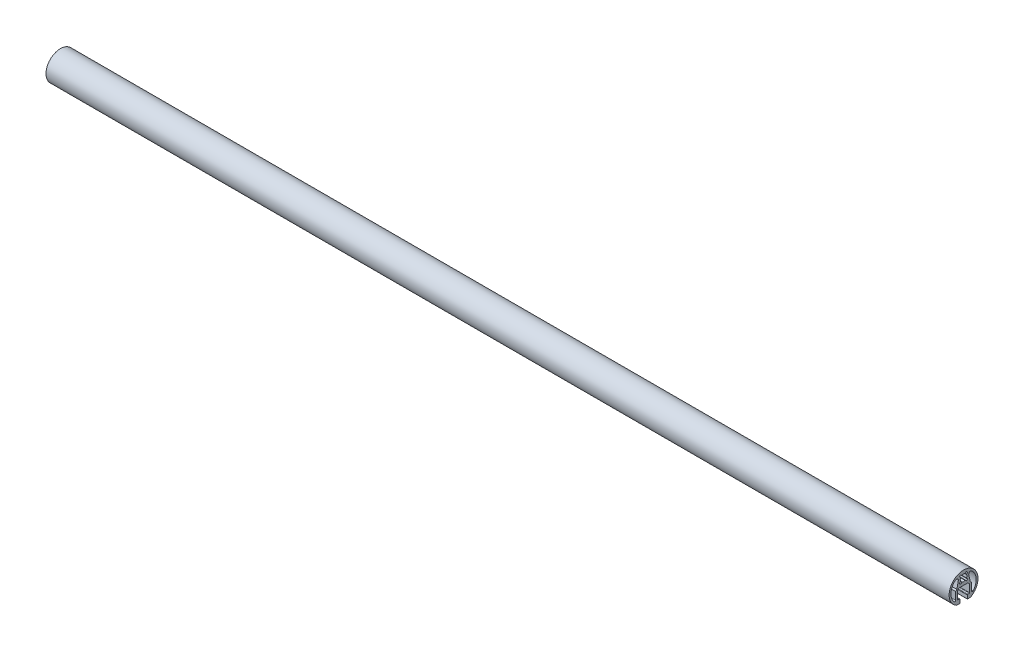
ISO-10303-21;
HEADER;
FILE_DESCRIPTION(('STEP AP214'),'2;1');
FILE_NAME('part.step','',(''),(''),'','','');
FILE_SCHEMA(('AUTOMOTIVE_DESIGN { 1 0 10303 214 1 1 1 1 }'));
ENDSEC;
DATA;
#1=APPLICATION_CONTEXT('core data for automotive mechanical design processes');
#2=APPLICATION_PROTOCOL_DEFINITION('international standard','automotive_design',2000,#1);
#3=PRODUCT_CONTEXT('',#1,'mechanical');
#4=PRODUCT('Part','Part','',(#3));
#5=PRODUCT_RELATED_PRODUCT_CATEGORY('part','',(#4));
#6=PRODUCT_DEFINITION_FORMATION('','',#4);
#7=PRODUCT_DEFINITION_CONTEXT('part definition',#1,'design');
#8=PRODUCT_DEFINITION('design','',#6,#7);
#9=PRODUCT_DEFINITION_SHAPE('','',#8);
#10=(LENGTH_UNIT() NAMED_UNIT(*) SI_UNIT(.MILLI.,.METRE.));
#11=(NAMED_UNIT(*) PLANE_ANGLE_UNIT() SI_UNIT($,.RADIAN.));
#12=(NAMED_UNIT(*) SI_UNIT($,.STERADIAN.) SOLID_ANGLE_UNIT());
#13=UNCERTAINTY_MEASURE_WITH_UNIT(LENGTH_MEASURE(1.E-05),#10,'distance_accuracy_value','');
#14=(GEOMETRIC_REPRESENTATION_CONTEXT(3) GLOBAL_UNCERTAINTY_ASSIGNED_CONTEXT((#13)) GLOBAL_UNIT_ASSIGNED_CONTEXT((#10,
#11,#12)) REPRESENTATION_CONTEXT('',''));
#15=CARTESIAN_POINT('',(0.,0.,0.));
#16=DIRECTION('',(0.,0.,1.));
#17=DIRECTION('',(1.,0.,0.));
#18=AXIS2_PLACEMENT_3D('',#15,#16,#17);
#19=CARTESIAN_POINT('',(1000.,-22.2000000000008,4.40000188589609));
#20=DIRECTION('',(-1.,0.,0.));
#21=DIRECTION('',(0.,0.,1.));
#22=AXIS2_PLACEMENT_3D('',#19,#20,#21);
#23=CYLINDRICAL_SURFACE('',#22,0.299999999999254);
#24=CARTESIAN_POINT('',(0.,-22.2000000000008,4.40000188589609));
#25=DIRECTION('',(1.,0.,0.));
#26=DIRECTION('',(0.,0.,-1.));
#27=AXIS2_PLACEMENT_3D('',#24,#25,#26);
#28=CIRCLE('',#27,0.299999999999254);
#29=CARTESIAN_POINT('',(0.,-22.5,4.40000181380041));
#30=VERTEX_POINT('',#29);
#31=CARTESIAN_POINT('',(0.,-22.1999987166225,4.10000188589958));
#32=VERTEX_POINT('',#31);
#33=EDGE_CURVE('E659',#30,#32,#28,.T.);
#34=ORIENTED_EDGE('',*,*,#33,.T.);
#35=DIRECTION('',(-1.,0.,0.));
#36=VECTOR('',#35,1.);
#37=CARTESIAN_POINT('',(1000.,-22.1999987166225,4.10000188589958));
#38=LINE('',#37,#36);
#39=CARTESIAN_POINT('',(1000.,-22.1999987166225,4.10000188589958));
#40=VERTEX_POINT('',#39);
#41=EDGE_CURVE('E12',#40,#32,#38,.T.);
#42=ORIENTED_EDGE('',*,*,#41,.F.);
#43=CARTESIAN_POINT('',(1000.,-22.2000000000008,4.40000188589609));
#44=DIRECTION('',(1.,0.,0.));
#45=DIRECTION('',(0.,0.,-1.));
#46=AXIS2_PLACEMENT_3D('',#43,#44,#45);
#47=CIRCLE('',#46,0.299999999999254);
#48=CARTESIAN_POINT('',(1000.,-22.5,4.40000181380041));
#49=VERTEX_POINT('',#48);
#50=EDGE_CURVE('E968',#49,#40,#47,.T.);
#51=ORIENTED_EDGE('',*,*,#50,.F.);
#52=DIRECTION('',(-1.,0.,0.));
#53=VECTOR('',#52,1.);
#54=CARTESIAN_POINT('',(1000.,-22.5,4.40000181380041));
#55=LINE('',#54,#53);
#56=EDGE_CURVE('E694',#49,#30,#55,.T.);
#57=ORIENTED_EDGE('',*,*,#56,.T.);
#58=EDGE_LOOP('',(#34,#42,#51,#57));
#59=FACE_BOUND('',#58,.T.);
#60=ADVANCED_FACE('F103',(#59),#23,.T.);
#61=CARTESIAN_POINT('',(1000.,-22.1999987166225,4.10000188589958));
#62=DIRECTION('',(0.,0.,1.));
#63=DIRECTION('',(0.,-1.,0.));
#64=AXIS2_PLACEMENT_3D('',#61,#62,#63);
#65=PLANE('',#64);
#66=DIRECTION('',(0.,1.,0.));
#67=VECTOR('',#66,1.);
#68=CARTESIAN_POINT('',(0.,-22.1999987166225,4.10000188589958));
#69=LINE('',#68,#67);
#70=CARTESIAN_POINT('',(0.,-18.4999987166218,4.10000188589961));
#71=VERTEX_POINT('',#70);
#72=EDGE_CURVE('E662',#32,#71,#69,.T.);
#73=ORIENTED_EDGE('',*,*,#72,.T.);
#74=DIRECTION('',(-1.,0.,0.));
#75=VECTOR('',#74,1.);
#76=CARTESIAN_POINT('',(1000.,-18.4999987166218,4.10000188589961));
#77=LINE('',#76,#75);
#78=CARTESIAN_POINT('',(1000.,-18.4999987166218,4.10000188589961));
#79=VERTEX_POINT('',#78);
#80=EDGE_CURVE('E113',#79,#71,#77,.T.);
#81=ORIENTED_EDGE('',*,*,#80,.F.);
#82=DIRECTION('',(0.,1.,0.));
#83=VECTOR('',#82,1.);
#84=CARTESIAN_POINT('',(1000.,-22.1999987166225,4.10000188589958));
#85=LINE('',#84,#83);
#86=EDGE_CURVE('E970',#40,#79,#85,.T.);
#87=ORIENTED_EDGE('',*,*,#86,.F.);
#88=ORIENTED_EDGE('',*,*,#41,.T.);
#89=EDGE_LOOP('',(#73,#81,#87,#88));
#90=FACE_BOUND('',#89,.T.);
#91=ADVANCED_FACE('F1026',(#90),#65,.F.);
#92=CARTESIAN_POINT('',(1000.,-18.4999987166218,4.60000188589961));
#93=DIRECTION('',(-1.,0.,0.));
#94=DIRECTION('',(0.,0.,1.));
#95=AXIS2_PLACEMENT_3D('',#92,#93,#94);
#96=CYLINDRICAL_SURFACE('',#95,0.5);
#97=CARTESIAN_POINT('',(0.,-18.4999987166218,4.60000188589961));
#98=DIRECTION('',(1.,0.,0.));
#99=DIRECTION('',(0.,0.,-1.));
#100=AXIS2_PLACEMENT_3D('',#97,#98,#99);
#101=CIRCLE('',#100,0.5);
#102=CARTESIAN_POINT('',(0.,-17.9999987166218,4.60000188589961));
#103=VERTEX_POINT('',#102);
#104=EDGE_CURVE('E664',#71,#103,#101,.T.);
#105=ORIENTED_EDGE('',*,*,#104,.T.);
#106=DIRECTION('',(-1.,0.,0.));
#107=VECTOR('',#106,1.);
#108=CARTESIAN_POINT('',(1000.,-17.9999987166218,4.60000188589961));
#109=LINE('',#108,#107);
#110=CARTESIAN_POINT('',(1000.,-17.9999987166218,4.60000188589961));
#111=VERTEX_POINT('',#110);
#112=EDGE_CURVE('E732',#111,#103,#109,.T.);
#113=ORIENTED_EDGE('',*,*,#112,.F.);
#114=CARTESIAN_POINT('',(1000.,-18.4999987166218,4.60000188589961));
#115=DIRECTION('',(1.,0.,0.));
#116=DIRECTION('',(0.,0.,-1.));
#117=AXIS2_PLACEMENT_3D('',#114,#115,#116);
#118=CIRCLE('',#117,0.5);
#119=EDGE_CURVE('E972',#79,#111,#118,.T.);
#120=ORIENTED_EDGE('',*,*,#119,.F.);
#121=ORIENTED_EDGE('',*,*,#80,.T.);
#122=EDGE_LOOP('',(#105,#113,#120,#121));
#123=FACE_BOUND('',#122,.T.);
#124=ADVANCED_FACE('F1031',(#123),#96,.T.);
#125=CARTESIAN_POINT('',(1000.,-17.9999987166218,4.60000188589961));
#126=DIRECTION('',(0.,-1.,0.));
#127=DIRECTION('',(0.,0.,-1.));
#128=AXIS2_PLACEMENT_3D('',#125,#126,#127);
#129=PLANE('',#128);
#130=DIRECTION('',(0.,0.,1.));
#131=VECTOR('',#130,1.);
#132=CARTESIAN_POINT('',(0.,-17.9999987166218,4.60000188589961));
#133=LINE('',#132,#131);
#134=CARTESIAN_POINT('',(0.,-17.9999987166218,6.50000188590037));
#135=VERTEX_POINT('',#134);
#136=EDGE_CURVE('E666',#103,#135,#133,.T.);
#137=ORIENTED_EDGE('',*,*,#136,.T.);
#138=DIRECTION('',(-1.,0.,0.));
#139=VECTOR('',#138,1.);
#140=CARTESIAN_POINT('',(1000.,-17.9999987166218,6.50000188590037));
#141=LINE('',#140,#139);
#142=CARTESIAN_POINT('',(1000.,-17.9999987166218,6.50000188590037));
#143=VERTEX_POINT('',#142);
#144=EDGE_CURVE('E729',#143,#135,#141,.T.);
#145=ORIENTED_EDGE('',*,*,#144,.F.);
#146=DIRECTION('',(0.,0.,1.));
#147=VECTOR('',#146,1.);
#148=CARTESIAN_POINT('',(1000.,-17.9999987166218,4.60000188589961));
#149=LINE('',#148,#147);
#150=EDGE_CURVE('E974',#111,#143,#149,.T.);
#151=ORIENTED_EDGE('',*,*,#150,.F.);
#152=ORIENTED_EDGE('',*,*,#112,.T.);
#153=EDGE_LOOP('',(#137,#145,#151,#152));
#154=FACE_BOUND('',#153,.T.);
#155=ADVANCED_FACE('F1487',(#154),#129,.F.);
#156=CARTESIAN_POINT('',(1000.,-17.6999987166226,6.50000188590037));
#157=DIRECTION('',(-1.,0.,0.));
#158=DIRECTION('',(0.,0.,1.));
#159=AXIS2_PLACEMENT_3D('',#156,#157,#158);
#160=CYLINDRICAL_SURFACE('',#159,0.299999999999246);
#161=CARTESIAN_POINT('',(0.,-17.6999987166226,6.50000188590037));
#162=DIRECTION('',(-1.,0.,0.));
#163=DIRECTION('',(0.,0.,-1.));
#164=AXIS2_PLACEMENT_3D('',#161,#162,#163);
#165=CIRCLE('',#164,0.299999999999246);
#166=CARTESIAN_POINT('',(0.,-17.6999987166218,6.80000188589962));
#167=VERTEX_POINT('',#166);
#168=EDGE_CURVE('E668',#135,#167,#165,.T.);
#169=ORIENTED_EDGE('',*,*,#168,.T.);
#170=DIRECTION('',(-1.,0.,0.));
#171=VECTOR('',#170,1.);
#172=CARTESIAN_POINT('',(1000.,-17.6999987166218,6.80000188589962));
#173=LINE('',#172,#171);
#174=CARTESIAN_POINT('',(1000.,-17.6999987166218,6.80000188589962));
#175=VERTEX_POINT('',#174);
#176=EDGE_CURVE('E726',#175,#167,#173,.T.);
#177=ORIENTED_EDGE('',*,*,#176,.F.);
#178=CARTESIAN_POINT('',(1000.,-17.6999987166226,6.50000188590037));
#179=DIRECTION('',(-1.,0.,0.));
#180=DIRECTION('',(0.,0.,-1.));
#181=AXIS2_PLACEMENT_3D('',#178,#179,#180);
#182=CIRCLE('',#181,0.299999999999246);
#183=EDGE_CURVE('E976',#143,#175,#182,.T.);
#184=ORIENTED_EDGE('',*,*,#183,.F.);
#185=ORIENTED_EDGE('',*,*,#144,.T.);
#186=EDGE_LOOP('',(#169,#177,#184,#185));
#187=FACE_BOUND('',#186,.T.);
#188=ADVANCED_FACE('F1478',(#187),#160,.F.);
#189=CARTESIAN_POINT('',(1000.,-17.6999987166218,6.80000188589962));
#190=DIRECTION('',(0.,0.,1.));
#191=DIRECTION('',(0.,-1.,0.));
#192=AXIS2_PLACEMENT_3D('',#189,#190,#191);
#193=PLANE('',#192);
#194=DIRECTION('',(0.,1.,0.));
#195=VECTOR('',#194,1.);
#196=CARTESIAN_POINT('',(0.,-17.6999987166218,6.80000188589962));
#197=LINE('',#196,#195);
#198=CARTESIAN_POINT('',(0.,-9.19999871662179,6.80000188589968));
#199=VERTEX_POINT('',#198);
#200=EDGE_CURVE('E670',#167,#199,#197,.T.);
#201=ORIENTED_EDGE('',*,*,#200,.T.);
#202=DIRECTION('',(-1.,0.,0.));
#203=VECTOR('',#202,1.);
#204=CARTESIAN_POINT('',(1000.,-9.19999871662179,6.80000188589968));
#205=LINE('',#204,#203);
#206=CARTESIAN_POINT('',(1000.,-9.19999871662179,6.80000188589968));
#207=VERTEX_POINT('',#206);
#208=EDGE_CURVE('E723',#207,#199,#205,.T.);
#209=ORIENTED_EDGE('',*,*,#208,.F.);
#210=DIRECTION('',(0.,1.,0.));
#211=VECTOR('',#210,1.);
#212=CARTESIAN_POINT('',(1000.,-17.6999987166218,6.80000188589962));
#213=LINE('',#212,#211);
#214=EDGE_CURVE('E978',#175,#207,#213,.T.);
#215=ORIENTED_EDGE('',*,*,#214,.F.);
#216=ORIENTED_EDGE('',*,*,#176,.T.);
#217=EDGE_LOOP('',(#201,#209,#215,#216));
#218=FACE_BOUND('',#217,.T.);
#219=ADVANCED_FACE('F1469',(#218),#193,.F.);
#220=CARTESIAN_POINT('',(1000.,-9.19999871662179,6.80000188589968));
#221=DIRECTION('',(0.,0.707106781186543,0.707106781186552));
#222=DIRECTION('',(0.,-0.707106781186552,0.707106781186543));
#223=AXIS2_PLACEMENT_3D('',#220,#221,#222);
#224=PLANE('',#223);
#225=DIRECTION('',(0.,0.707106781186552,-0.707106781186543));
#226=VECTOR('',#225,1.);
#227=CARTESIAN_POINT('',(0.,-9.19999871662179,6.80000188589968));
#228=LINE('',#227,#226);
#229=CARTESIAN_POINT('',(0.,-7.19999871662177,4.80000188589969));
#230=VERTEX_POINT('',#229);
#231=EDGE_CURVE('E672',#199,#230,#228,.T.);
#232=ORIENTED_EDGE('',*,*,#231,.T.);
#233=DIRECTION('',(-1.,0.,0.));
#234=VECTOR('',#233,1.);
#235=CARTESIAN_POINT('',(1000.,-7.19999871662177,4.80000188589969));
#236=LINE('',#235,#234);
#237=CARTESIAN_POINT('',(1000.,-7.19999871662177,4.80000188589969));
#238=VERTEX_POINT('',#237);
#239=EDGE_CURVE('E720',#238,#230,#236,.T.);
#240=ORIENTED_EDGE('',*,*,#239,.F.);
#241=DIRECTION('',(0.,0.707106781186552,-0.707106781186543));
#242=VECTOR('',#241,1.);
#243=CARTESIAN_POINT('',(1000.,-9.19999871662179,6.80000188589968));
#244=LINE('',#243,#242);
#245=EDGE_CURVE('E980',#207,#238,#244,.T.);
#246=ORIENTED_EDGE('',*,*,#245,.F.);
#247=ORIENTED_EDGE('',*,*,#208,.T.);
#248=EDGE_LOOP('',(#232,#240,#246,#247));
#249=FACE_BOUND('',#248,.T.);
#250=ADVANCED_FACE('F1460',(#249),#224,.F.);
#251=CARTESIAN_POINT('',(1000.,-7.19999871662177,4.80000188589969));
#252=DIRECTION('',(0.,1.,0.));
#253=DIRECTION('',(0.,0.,1.));
#254=AXIS2_PLACEMENT_3D('',#251,#252,#253);
#255=PLANE('',#254);
#256=DIRECTION('',(0.,0.,-1.));
#257=VECTOR('',#256,1.);
#258=CARTESIAN_POINT('',(0.,-7.19999871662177,4.80000188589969));
#259=LINE('',#258,#257);
#260=CARTESIAN_POINT('',(0.,-7.19999871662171,-4.79999811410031));
#261=VERTEX_POINT('',#260);
#262=EDGE_CURVE('E674',#230,#261,#259,.T.);
#263=ORIENTED_EDGE('',*,*,#262,.T.);
#264=DIRECTION('',(-1.,0.,0.));
#265=VECTOR('',#264,1.);
#266=CARTESIAN_POINT('',(1000.,-7.19999871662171,-4.79999811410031));
#267=LINE('',#266,#265);
#268=CARTESIAN_POINT('',(1000.,-7.19999871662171,-4.79999811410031));
#269=VERTEX_POINT('',#268);
#270=EDGE_CURVE('E717',#269,#261,#267,.T.);
#271=ORIENTED_EDGE('',*,*,#270,.F.);
#272=DIRECTION('',(0.,0.,-1.));
#273=VECTOR('',#272,1.);
#274=CARTESIAN_POINT('',(1000.,-7.19999871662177,4.80000188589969));
#275=LINE('',#274,#273);
#276=EDGE_CURVE('E982',#238,#269,#275,.T.);
#277=ORIENTED_EDGE('',*,*,#276,.F.);
#278=ORIENTED_EDGE('',*,*,#239,.T.);
#279=EDGE_LOOP('',(#263,#271,#277,#278));
#280=FACE_BOUND('',#279,.T.);
#281=ADVANCED_FACE('F1451',(#280),#255,.F.);
#282=CARTESIAN_POINT('',(1000.,-7.19999871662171,-4.79999811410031));
#283=DIRECTION('',(0.,0.707106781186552,-0.707106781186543));
#284=DIRECTION('',(0.,0.707106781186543,0.707106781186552));
#285=AXIS2_PLACEMENT_3D('',#282,#283,#284);
#286=PLANE('',#285);
#287=DIRECTION('',(0.,-0.707106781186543,-0.707106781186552));
#288=VECTOR('',#287,1.);
#289=CARTESIAN_POINT('',(0.,-7.19999871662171,-4.79999811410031));
#290=LINE('',#289,#288);
#291=CARTESIAN_POINT('',(0.,-9.19999871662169,-6.79999811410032));
#292=VERTEX_POINT('',#291);
#293=EDGE_CURVE('E676',#261,#292,#290,.T.);
#294=ORIENTED_EDGE('',*,*,#293,.T.);
#295=DIRECTION('',(-1.,0.,0.));
#296=VECTOR('',#295,1.);
#297=CARTESIAN_POINT('',(1000.,-9.19999871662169,-6.79999811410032));
#298=LINE('',#297,#296);
#299=CARTESIAN_POINT('',(1000.,-9.19999871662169,-6.79999811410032));
#300=VERTEX_POINT('',#299);
#301=EDGE_CURVE('E714',#300,#292,#298,.T.);
#302=ORIENTED_EDGE('',*,*,#301,.F.);
#303=DIRECTION('',(0.,-0.707106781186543,-0.707106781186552));
#304=VECTOR('',#303,1.);
#305=CARTESIAN_POINT('',(1000.,-7.19999871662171,-4.79999811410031));
#306=LINE('',#305,#304);
#307=EDGE_CURVE('E984',#269,#300,#306,.T.);
#308=ORIENTED_EDGE('',*,*,#307,.F.);
#309=ORIENTED_EDGE('',*,*,#270,.T.);
#310=EDGE_LOOP('',(#294,#302,#308,#309));
#311=FACE_BOUND('',#310,.T.);
#312=ADVANCED_FACE('F1442',(#311),#286,.F.);
#313=CARTESIAN_POINT('',(1000.,-9.19999871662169,-6.79999811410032));
#314=DIRECTION('',(0.,0.,-1.));
#315=DIRECTION('',(0.,1.,0.));
#316=AXIS2_PLACEMENT_3D('',#313,#314,#315);
#317=PLANE('',#316);
#318=DIRECTION('',(0.,-1.,0.));
#319=VECTOR('',#318,1.);
#320=CARTESIAN_POINT('',(0.,-9.19999871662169,-6.79999811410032));
#321=LINE('',#320,#319);
#322=CARTESIAN_POINT('',(0.,-17.6999987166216,-6.79999811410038));
#323=VERTEX_POINT('',#322);
#324=EDGE_CURVE('E678',#292,#323,#321,.T.);
#325=ORIENTED_EDGE('',*,*,#324,.T.);
#326=DIRECTION('',(-1.,0.,0.));
#327=VECTOR('',#326,1.);
#328=CARTESIAN_POINT('',(1000.,-17.6999987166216,-6.79999811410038));
#329=LINE('',#328,#327);
#330=CARTESIAN_POINT('',(1000.,-17.6999987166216,-6.79999811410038));
#331=VERTEX_POINT('',#330);
#332=EDGE_CURVE('E711',#331,#323,#329,.T.);
#333=ORIENTED_EDGE('',*,*,#332,.F.);
#334=DIRECTION('',(0.,-1.,0.));
#335=VECTOR('',#334,1.);
#336=CARTESIAN_POINT('',(1000.,-9.19999871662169,-6.79999811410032));
#337=LINE('',#336,#335);
#338=EDGE_CURVE('E986',#300,#331,#337,.T.);
#339=ORIENTED_EDGE('',*,*,#338,.F.);
#340=ORIENTED_EDGE('',*,*,#301,.T.);
#341=EDGE_LOOP('',(#325,#333,#339,#340));
#342=FACE_BOUND('',#341,.T.);
#343=ADVANCED_FACE('F1433',(#342),#317,.F.);
#344=CARTESIAN_POINT('',(1000.,-17.6999987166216,-6.49999811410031));
#345=DIRECTION('',(-1.,0.,0.));
#346=DIRECTION('',(0.,0.,1.));
#347=AXIS2_PLACEMENT_3D('',#344,#345,#346);
#348=CYLINDRICAL_SURFACE('',#347,0.300000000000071);
#349=CARTESIAN_POINT('',(0.,-17.6999987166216,-6.49999811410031));
#350=DIRECTION('',(-1.,0.,0.));
#351=DIRECTION('',(0.,0.,-1.));
#352=AXIS2_PLACEMENT_3D('',#349,#350,#351);
#353=CIRCLE('',#352,0.300000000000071);
#354=CARTESIAN_POINT('',(0.,-17.9999987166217,-6.49999811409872));
#355=VERTEX_POINT('',#354);
#356=EDGE_CURVE('E680',#323,#355,#353,.T.);
#357=ORIENTED_EDGE('',*,*,#356,.T.);
#358=DIRECTION('',(-1.,0.,0.));
#359=VECTOR('',#358,1.);
#360=CARTESIAN_POINT('',(1000.,-17.9999987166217,-6.49999811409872));
#361=LINE('',#360,#359);
#362=CARTESIAN_POINT('',(1000.,-17.9999987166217,-6.49999811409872));
#363=VERTEX_POINT('',#362);
#364=EDGE_CURVE('E708',#363,#355,#361,.T.);
#365=ORIENTED_EDGE('',*,*,#364,.F.);
#366=CARTESIAN_POINT('',(1000.,-17.6999987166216,-6.49999811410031));
#367=DIRECTION('',(-1.,0.,0.));
#368=DIRECTION('',(0.,0.,-1.));
#369=AXIS2_PLACEMENT_3D('',#366,#367,#368);
#370=CIRCLE('',#369,0.300000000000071);
#371=EDGE_CURVE('E988',#331,#363,#370,.T.);
#372=ORIENTED_EDGE('',*,*,#371,.F.);
#373=ORIENTED_EDGE('',*,*,#332,.T.);
#374=EDGE_LOOP('',(#357,#365,#372,#373));
#375=FACE_BOUND('',#374,.T.);
#376=ADVANCED_FACE('F1424',(#375),#348,.F.);
#377=CARTESIAN_POINT('',(1000.,-17.9999987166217,-6.49999811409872));
#378=DIRECTION('',(0.,-1.,0.));
#379=DIRECTION('',(0.,0.,-1.));
#380=AXIS2_PLACEMENT_3D('',#377,#378,#379);
#381=PLANE('',#380);
#382=DIRECTION('',(0.,0.,1.));
#383=VECTOR('',#382,1.);
#384=CARTESIAN_POINT('',(0.,-17.9999987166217,-6.49999811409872));
#385=LINE('',#384,#383);
#386=CARTESIAN_POINT('',(0.,-17.9999987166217,-4.59999811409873));
#387=VERTEX_POINT('',#386);
#388=EDGE_CURVE('E682',#355,#387,#385,.T.);
#389=ORIENTED_EDGE('',*,*,#388,.T.);
#390=DIRECTION('',(-1.,0.,0.));
#391=VECTOR('',#390,1.);
#392=CARTESIAN_POINT('',(1000.,-17.9999987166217,-4.59999811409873));
#393=LINE('',#392,#391);
#394=CARTESIAN_POINT('',(1000.,-17.9999987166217,-4.59999811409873));
#395=VERTEX_POINT('',#394);
#396=EDGE_CURVE('E705',#395,#387,#393,.T.);
#397=ORIENTED_EDGE('',*,*,#396,.F.);
#398=DIRECTION('',(0.,0.,1.));
#399=VECTOR('',#398,1.);
#400=CARTESIAN_POINT('',(1000.,-17.9999987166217,-6.49999811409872));
#401=LINE('',#400,#399);
#402=EDGE_CURVE('E990',#363,#395,#401,.T.);
#403=ORIENTED_EDGE('',*,*,#402,.F.);
#404=ORIENTED_EDGE('',*,*,#364,.T.);
#405=EDGE_LOOP('',(#389,#397,#403,#404));
#406=FACE_BOUND('',#405,.T.);
#407=ADVANCED_FACE('F1415',(#406),#381,.F.);
#408=CARTESIAN_POINT('',(1000.,-18.4999987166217,-4.59999811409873));
#409=DIRECTION('',(-1.,0.,0.));
#410=DIRECTION('',(0.,0.,1.));
#411=AXIS2_PLACEMENT_3D('',#408,#409,#410);
#412=CYLINDRICAL_SURFACE('',#411,0.5);
#413=CARTESIAN_POINT('',(0.,-18.4999987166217,-4.59999811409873));
#414=DIRECTION('',(1.,0.,0.));
#415=DIRECTION('',(0.,0.,-1.));
#416=AXIS2_PLACEMENT_3D('',#413,#414,#415);
#417=CIRCLE('',#416,0.5);
#418=CARTESIAN_POINT('',(0.,-18.4999987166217,-4.09999811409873));
#419=VERTEX_POINT('',#418);
#420=EDGE_CURVE('E684',#387,#419,#417,.T.);
#421=ORIENTED_EDGE('',*,*,#420,.T.);
#422=DIRECTION('',(-1.,0.,0.));
#423=VECTOR('',#422,1.);
#424=CARTESIAN_POINT('',(1000.,-18.4999987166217,-4.09999811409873));
#425=LINE('',#424,#423);
#426=CARTESIAN_POINT('',(1000.,-18.4999987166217,-4.09999811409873));
#427=VERTEX_POINT('',#426);
#428=EDGE_CURVE('E702',#427,#419,#425,.T.);
#429=ORIENTED_EDGE('',*,*,#428,.F.);
#430=CARTESIAN_POINT('',(1000.,-18.4999987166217,-4.59999811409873));
#431=DIRECTION('',(1.,0.,0.));
#432=DIRECTION('',(0.,0.,-1.));
#433=AXIS2_PLACEMENT_3D('',#430,#431,#432);
#434=CIRCLE('',#433,0.5);
#435=EDGE_CURVE('E992',#395,#427,#434,.T.);
#436=ORIENTED_EDGE('',*,*,#435,.F.);
#437=ORIENTED_EDGE('',*,*,#396,.T.);
#438=EDGE_LOOP('',(#421,#429,#436,#437));
#439=FACE_BOUND('',#438,.T.);
#440=ADVANCED_FACE('F1407',(#439),#412,.T.);
#441=CARTESIAN_POINT('',(1000.,-18.4999987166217,-4.09999811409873));
#442=DIRECTION('',(0.,0.,-1.));
#443=DIRECTION('',(0.,1.,0.));
#444=AXIS2_PLACEMENT_3D('',#441,#442,#443);
#445=PLANE('',#444);
#446=DIRECTION('',(0.,-1.,0.));
#447=VECTOR('',#446,1.);
#448=CARTESIAN_POINT('',(0.,-18.4999987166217,-4.09999811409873));
#449=LINE('',#448,#447);
#450=CARTESIAN_POINT('',(0.,-22.1999987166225,-4.09999811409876));
#451=VERTEX_POINT('',#450);
#452=EDGE_CURVE('E686',#419,#451,#449,.T.);
#453=ORIENTED_EDGE('',*,*,#452,.T.);
#454=DIRECTION('',(-1.,0.,0.));
#455=VECTOR('',#454,1.);
#456=CARTESIAN_POINT('',(1000.,-22.1999987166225,-4.09999811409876));
#457=LINE('',#456,#455);
#458=CARTESIAN_POINT('',(1000.,-22.1999987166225,-4.09999811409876));
#459=VERTEX_POINT('',#458);
#460=EDGE_CURVE('E699',#459,#451,#457,.T.);
#461=ORIENTED_EDGE('',*,*,#460,.F.);
#462=DIRECTION('',(0.,-1.,0.));
#463=VECTOR('',#462,1.);
#464=CARTESIAN_POINT('',(1000.,-18.4999987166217,-4.09999811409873));
#465=LINE('',#464,#463);
#466=EDGE_CURVE('E994',#427,#459,#465,.T.);
#467=ORIENTED_EDGE('',*,*,#466,.F.);
#468=ORIENTED_EDGE('',*,*,#428,.T.);
#469=EDGE_LOOP('',(#453,#461,#467,#468));
#470=FACE_BOUND('',#469,.T.);
#471=ADVANCED_FACE('F1000',(#470),#445,.F.);
#472=CARTESIAN_POINT('',(1000.,-22.2,-4.39999811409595));
#473=DIRECTION('',(-1.,0.,0.));
#474=DIRECTION('',(0.,0.,1.));
#475=AXIS2_PLACEMENT_3D('',#472,#473,#474);
#476=CYLINDRICAL_SURFACE('',#475,0.299999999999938);
#477=CARTESIAN_POINT('',(0.,-22.2,-4.39999811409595));
#478=DIRECTION('',(1.,0.,0.));
#479=DIRECTION('',(0.,0.,-1.));
#480=AXIS2_PLACEMENT_3D('',#477,#478,#479);
#481=CIRCLE('',#480,0.299999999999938);
#482=CARTESIAN_POINT('',(0.,-22.5,-4.39999818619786));
#483=VERTEX_POINT('',#482);
#484=EDGE_CURVE('E688',#451,#483,#481,.T.);
#485=ORIENTED_EDGE('',*,*,#484,.T.);
#486=DIRECTION('',(-1.,0.,0.));
#487=VECTOR('',#486,1.);
#488=CARTESIAN_POINT('',(1000.,-22.5,-4.39999818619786));
#489=LINE('',#488,#487);
#490=CARTESIAN_POINT('',(1000.,-22.5,-4.39999818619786));
#491=VERTEX_POINT('',#490);
#492=EDGE_CURVE('E518',#491,#483,#489,.T.);
#493=ORIENTED_EDGE('',*,*,#492,.F.);
#494=CARTESIAN_POINT('',(1000.,-22.2,-4.39999811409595));
#495=DIRECTION('',(1.,0.,0.));
#496=DIRECTION('',(0.,0.,-1.));
#497=AXIS2_PLACEMENT_3D('',#494,#495,#496);
#498=CIRCLE('',#497,0.299999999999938);
#499=EDGE_CURVE('E509',#459,#491,#498,.T.);
#500=ORIENTED_EDGE('',*,*,#499,.F.);
#501=ORIENTED_EDGE('',*,*,#460,.T.);
#502=EDGE_LOOP('',(#485,#493,#500,#501));
#503=FACE_BOUND('',#502,.T.);
#504=ADVANCED_FACE('F1004',(#503),#476,.T.);
#505=CARTESIAN_POINT('',(1000.,-22.5,-4.39999818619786));
#506=DIRECTION('',(0.,1.,0.));
#507=DIRECTION('',(0.,0.,1.));
#508=AXIS2_PLACEMENT_3D('',#505,#506,#507);
#509=PLANE('',#508);
#510=DIRECTION('',(0.,0.,-1.));
#511=VECTOR('',#510,1.);
#512=CARTESIAN_POINT('',(0.,-22.5,-4.39999818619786));
#513=LINE('',#512,#511);
#514=CARTESIAN_POINT('',(0.,-22.4999999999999,-7.74596504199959));
#515=VERTEX_POINT('',#514);
#516=EDGE_CURVE('E517',#483,#515,#513,.T.);
#517=ORIENTED_EDGE('',*,*,#516,.T.);
#518=DIRECTION('',(-1.,0.,0.));
#519=VECTOR('',#518,1.);
#520=CARTESIAN_POINT('',(1000.,-22.4999999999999,-7.74596504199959));
#521=LINE('',#520,#519);
#522=CARTESIAN_POINT('',(1000.,-22.4999999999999,-7.74596504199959));
#523=VERTEX_POINT('',#522);
#524=EDGE_CURVE('E514',#523,#515,#521,.T.);
#525=ORIENTED_EDGE('',*,*,#524,.F.);
#526=DIRECTION('',(0.,0.,-1.));
#527=VECTOR('',#526,1.);
#528=CARTESIAN_POINT('',(1000.,-22.5,-4.39999818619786));
#529=LINE('',#528,#527);
#530=EDGE_CURVE('E503',#491,#523,#529,.T.);
#531=ORIENTED_EDGE('',*,*,#530,.F.);
#532=ORIENTED_EDGE('',*,*,#492,.T.);
#533=EDGE_LOOP('',(#517,#525,#531,#532));
#534=FACE_BOUND('',#533,.T.);
#535=ADVANCED_FACE('F515',(#534),#509,.F.);
#536=CARTESIAN_POINT('',(1000.,-8.50000013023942,1.88590051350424E-06));
#537=DIRECTION('',(-1.,0.,0.));
#538=DIRECTION('',(0.,0.,1.));
#539=AXIS2_PLACEMENT_3D('',#536,#537,#538);
#540=CYLINDRICAL_SURFACE('',#539,16.0000000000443);
#541=CARTESIAN_POINT('',(0.,-8.50000013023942,1.88590051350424E-06));
#542=DIRECTION('',(1.,0.,0.));
#543=DIRECTION('',(0.,0.,-1.));
#544=AXIS2_PLACEMENT_3D('',#541,#542,#543);
#545=CIRCLE('',#544,16.0000000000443);
#546=CARTESIAN_POINT('',(0.,-22.5000000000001,7.74596881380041));
#547=VERTEX_POINT('',#546);
#548=EDGE_CURVE('E313',#515,#547,#545,.T.);
#549=ORIENTED_EDGE('',*,*,#548,.T.);
#550=DIRECTION('',(-1.,0.,0.));
#551=VECTOR('',#550,1.);
#552=CARTESIAN_POINT('',(1000.,-22.5000000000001,7.74596881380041));
#553=LINE('',#552,#551);
#554=CARTESIAN_POINT('',(1000.,-22.5000000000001,7.74596881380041));
#555=VERTEX_POINT('',#554);
#556=EDGE_CURVE('E519',#555,#547,#553,.T.);
#557=ORIENTED_EDGE('',*,*,#556,.F.);
#558=CARTESIAN_POINT('',(1000.,-8.50000013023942,1.88590051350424E-06));
#559=DIRECTION('',(1.,0.,0.));
#560=DIRECTION('',(0.,0.,-1.));
#561=AXIS2_PLACEMENT_3D('',#558,#559,#560);
#562=CIRCLE('',#561,16.0000000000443);
#563=EDGE_CURVE('E507',#523,#555,#562,.T.);
#564=ORIENTED_EDGE('',*,*,#563,.F.);
#565=ORIENTED_EDGE('',*,*,#524,.T.);
#566=EDGE_LOOP('',(#549,#557,#564,#565));
#567=FACE_BOUND('',#566,.T.);
#568=ADVANCED_FACE('F521',(#567),#540,.T.);
#569=CARTESIAN_POINT('',(1000.,3.1819800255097,-4.17193117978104));
#570=DIRECTION('',(-1.,0.,0.));
#571=DIRECTION('',(0.,0.,1.));
#572=AXIS2_PLACEMENT_3D('',#569,#570,#571);
#573=CYLINDRICAL_SURFACE('',#572,0.299999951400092);
#574=CARTESIAN_POINT('',(0.,3.1819800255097,-4.17193117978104));
#575=DIRECTION('',(1.,0.,0.));
#576=DIRECTION('',(0.,0.,-1.));
#577=AXIS2_PLACEMENT_3D('',#574,#575,#576);
#578=CIRCLE('',#577,0.299999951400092);
#579=CARTESIAN_POINT('',(0.,2.9698475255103,-4.38406267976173));
#580=VERTEX_POINT('',#579);
#581=CARTESIAN_POINT('',(0.,3.39411202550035,-4.38406317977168));
#582=VERTEX_POINT('',#581);
#583=EDGE_CURVE('E563',#580,#582,#578,.T.);
#584=ORIENTED_EDGE('',*,*,#583,.F.);
#585=DIRECTION('',(-1.,0.,0.));
#586=VECTOR('',#585,1.);
#587=CARTESIAN_POINT('',(1000.,2.9698475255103,-4.38406267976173));
#588=LINE('',#587,#586);
#589=CARTESIAN_POINT('',(1000.,2.9698475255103,-4.38406267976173));
#590=VERTEX_POINT('',#589);
#591=EDGE_CURVE('E696',#590,#580,#588,.T.);
#592=ORIENTED_EDGE('',*,*,#591,.F.);
#593=CARTESIAN_POINT('',(1000.,3.1819800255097,-4.17193117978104));
#594=DIRECTION('',(1.,0.,0.));
#595=DIRECTION('',(0.,0.,-1.));
#596=AXIS2_PLACEMENT_3D('',#593,#594,#595);
#597=CIRCLE('',#596,0.299999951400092);
#598=CARTESIAN_POINT('',(1000.,3.39411202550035,-4.38406317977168));
#599=VERTEX_POINT('',#598);
#600=EDGE_CURVE('E872',#590,#599,#597,.T.);
#601=ORIENTED_EDGE('',*,*,#600,.T.);
#602=DIRECTION('',(-1.,0.,0.));
#603=VECTOR('',#602,1.);
#604=CARTESIAN_POINT('',(1000.,3.39411202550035,-4.38406317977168));
#605=LINE('',#604,#603);
#606=EDGE_CURVE('E737',#599,#582,#605,.T.);
#607=ORIENTED_EDGE('',*,*,#606,.T.);
#608=EDGE_LOOP('',(#584,#592,#601,#607));
#609=FACE_BOUND('',#608,.T.);
#610=ADVANCED_FACE('F1161',(#609),#573,.F.);
#611=CARTESIAN_POINT('',(1000.,1.9490772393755,-3.36329239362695));
#612=DIRECTION('',(0.,0.707106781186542,0.707106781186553));
#613=DIRECTION('',(0.,-0.707106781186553,0.707106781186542));
#614=AXIS2_PLACEMENT_3D('',#611,#612,#613);
#615=PLANE('',#614);
#616=DIRECTION('',(0.,0.707106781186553,-0.707106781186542));
#617=VECTOR('',#616,1.);
#618=CARTESIAN_POINT('',(0.,1.9490772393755,-3.36329239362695));
#619=LINE('',#618,#617);
#620=CARTESIAN_POINT('',(0.,1.9490772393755,-3.36329239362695));
#621=VERTEX_POINT('',#620);
#622=EDGE_CURVE('E566',#621,#580,#619,.T.);
#623=ORIENTED_EDGE('',*,*,#622,.F.);
#624=DIRECTION('',(-1.,0.,0.));
#625=VECTOR('',#624,1.);
#626=CARTESIAN_POINT('',(1000.,1.9490772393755,-3.36329239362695));
#627=LINE('',#626,#625);
#628=CARTESIAN_POINT('',(1000.,1.9490772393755,-3.36329239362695));
#629=VERTEX_POINT('',#628);
#630=EDGE_CURVE('E798',#629,#621,#627,.T.);
#631=ORIENTED_EDGE('',*,*,#630,.F.);
#632=DIRECTION('',(0.,0.707106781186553,-0.707106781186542));
#633=VECTOR('',#632,1.);
#634=CARTESIAN_POINT('',(1000.,1.9490772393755,-3.36329239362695));
#635=LINE('',#634,#633);
#636=EDGE_CURVE('E875',#629,#590,#635,.T.);
#637=ORIENTED_EDGE('',*,*,#636,.T.);
#638=ORIENTED_EDGE('',*,*,#591,.T.);
#639=EDGE_LOOP('',(#623,#631,#637,#638));
#640=FACE_BOUND('',#639,.T.);
#641=ADVANCED_FACE('F1157',(#640),#615,.T.);
#642=CARTESIAN_POINT('',(1000.,1.73694520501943,-3.57542442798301));
#643=DIRECTION('',(-1.,0.,0.));
#644=DIRECTION('',(0.,0.,1.));
#645=AXIS2_PLACEMENT_3D('',#642,#643,#644);
#646=CYLINDRICAL_SURFACE('',#645,0.300000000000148);
#647=CARTESIAN_POINT('',(0.,1.73694520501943,-3.57542442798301));
#648=DIRECTION('',(-1.,0.,0.));
#649=DIRECTION('',(0.,0.,-1.));
#650=AXIS2_PLACEMENT_3D('',#647,#648,#649);
#651=CIRCLE('',#650,0.300000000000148);
#652=CARTESIAN_POINT('',(0.,1.60585493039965,-3.30558125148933));
#653=VERTEX_POINT('',#652);
#654=EDGE_CURVE('E569',#653,#621,#651,.T.);
#655=ORIENTED_EDGE('',*,*,#654,.F.);
#656=DIRECTION('',(-1.,0.,0.));
#657=VECTOR('',#656,1.);
#658=CARTESIAN_POINT('',(1000.,1.60585493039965,-3.30558125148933));
#659=LINE('',#658,#657);
#660=CARTESIAN_POINT('',(1000.,1.60585493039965,-3.30558125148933));
#661=VERTEX_POINT('',#660);
#662=EDGE_CURVE('E796',#661,#653,#659,.T.);
#663=ORIENTED_EDGE('',*,*,#662,.F.);
#664=CARTESIAN_POINT('',(1000.,1.73694520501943,-3.57542442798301));
#665=DIRECTION('',(-1.,0.,0.));
#666=DIRECTION('',(0.,0.,-1.));
#667=AXIS2_PLACEMENT_3D('',#664,#665,#666);
#668=CIRCLE('',#667,0.300000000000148);
#669=EDGE_CURVE('E878',#661,#629,#668,.T.);
#670=ORIENTED_EDGE('',*,*,#669,.T.);
#671=ORIENTED_EDGE('',*,*,#630,.T.);
#672=EDGE_LOOP('',(#655,#663,#670,#671));
#673=FACE_BOUND('',#672,.T.);
#674=ADVANCED_FACE('F1153',(#673),#646,.T.);
#675=CARTESIAN_POINT('',(1000.,0.,0.));
#676=DIRECTION('',(-1.,0.,0.));
#677=DIRECTION('',(0.,0.,1.));
#678=AXIS2_PLACEMENT_3D('',#675,#676,#677);
#679=CYLINDRICAL_SURFACE('',#678,3.67500169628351);
#680=CARTESIAN_POINT('',(0.,0.,0.));
#681=DIRECTION('',(1.,0.,0.));
#682=DIRECTION('',(0.,0.,-1.));
#683=AXIS2_PLACEMENT_3D('',#680,#681,#682);
#684=CIRCLE('',#683,3.67500169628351);
#685=CARTESIAN_POINT('',(0.,-1.60585561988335,-3.30558091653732));
#686=VERTEX_POINT('',#685);
#687=EDGE_CURVE('E572',#686,#653,#684,.T.);
#688=ORIENTED_EDGE('',*,*,#687,.F.);
#689=DIRECTION('',(-1.,0.,0.));
#690=VECTOR('',#689,1.);
#691=CARTESIAN_POINT('',(1000.,-1.60585561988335,-3.30558091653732));
#692=LINE('',#691,#690);
#693=CARTESIAN_POINT('',(1000.,-1.60585561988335,-3.30558091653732));
#694=VERTEX_POINT('',#693);
#695=EDGE_CURVE('E794',#694,#686,#692,.T.);
#696=ORIENTED_EDGE('',*,*,#695,.F.);
#697=CARTESIAN_POINT('',(1000.,0.,0.));
#698=DIRECTION('',(1.,0.,0.));
#699=DIRECTION('',(0.,0.,-1.));
#700=AXIS2_PLACEMENT_3D('',#697,#698,#699);
#701=CIRCLE('',#700,3.67500169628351);
#702=EDGE_CURVE('E881',#694,#661,#701,.T.);
#703=ORIENTED_EDGE('',*,*,#702,.T.);
#704=ORIENTED_EDGE('',*,*,#662,.T.);
#705=EDGE_LOOP('',(#688,#696,#703,#704));
#706=FACE_BOUND('',#705,.T.);
#707=ADVANCED_FACE('F1149',(#706),#679,.F.);
#708=CARTESIAN_POINT('',(1000.,-1.73694579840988,-3.57542413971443));
#709=DIRECTION('',(-1.,0.,0.));
#710=DIRECTION('',(0.,0.,1.));
#711=AXIS2_PLACEMENT_3D('',#708,#709,#710);
#712=CYLINDRICAL_SURFACE('',#711,0.300000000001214);
#713=CARTESIAN_POINT('',(0.,-1.73694579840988,-3.57542413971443));
#714=DIRECTION('',(-1.,0.,0.));
#715=DIRECTION('',(0.,0.,-1.));
#716=AXIS2_PLACEMENT_3D('',#713,#714,#715);
#717=CIRCLE('',#716,0.300000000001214);
#718=CARTESIAN_POINT('',(0.,-1.9490778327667,-3.36329210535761));
#719=VERTEX_POINT('',#718);
#720=EDGE_CURVE('E575',#719,#686,#717,.T.);
#721=ORIENTED_EDGE('',*,*,#720,.F.);
#722=DIRECTION('',(-1.,0.,0.));
#723=VECTOR('',#722,1.);
#724=CARTESIAN_POINT('',(1000.,-1.9490778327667,-3.36329210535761));
#725=LINE('',#724,#723);
#726=CARTESIAN_POINT('',(1000.,-1.9490778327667,-3.36329210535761));
#727=VERTEX_POINT('',#726);
#728=EDGE_CURVE('E792',#727,#719,#725,.T.);
#729=ORIENTED_EDGE('',*,*,#728,.F.);
#730=CARTESIAN_POINT('',(1000.,-1.73694579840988,-3.57542413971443));
#731=DIRECTION('',(-1.,0.,0.));
#732=DIRECTION('',(0.,0.,-1.));
#733=AXIS2_PLACEMENT_3D('',#730,#731,#732);
#734=CIRCLE('',#733,0.300000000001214);
#735=EDGE_CURVE('E884',#727,#694,#734,.T.);
#736=ORIENTED_EDGE('',*,*,#735,.T.);
#737=ORIENTED_EDGE('',*,*,#695,.T.);
#738=EDGE_LOOP('',(#721,#729,#736,#737));
#739=FACE_BOUND('',#738,.T.);
#740=ADVANCED_FACE('F1145',(#739),#712,.T.);
#741=CARTESIAN_POINT('',(1000.,-2.96984843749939,-4.38406271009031));
#742=DIRECTION('',(0.,-0.707106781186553,0.707106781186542));
#743=DIRECTION('',(0.,-0.707106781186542,-0.707106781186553));
#744=AXIS2_PLACEMENT_3D('',#741,#742,#743);
#745=PLANE('',#744);
#746=DIRECTION('',(0.,0.707106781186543,0.707106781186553));
#747=VECTOR('',#746,1.);
#748=CARTESIAN_POINT('',(0.,-2.96984843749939,-4.38406271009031));
#749=LINE('',#748,#747);
#750=CARTESIAN_POINT('',(0.,-2.96984843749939,-4.38406271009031));
#751=VERTEX_POINT('',#750);
#752=EDGE_CURVE('E578',#751,#719,#749,.T.);
#753=ORIENTED_EDGE('',*,*,#752,.F.);
#754=DIRECTION('',(-1.,0.,0.));
#755=VECTOR('',#754,1.);
#756=CARTESIAN_POINT('',(1000.,-2.96984843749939,-4.38406271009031));
#757=LINE('',#756,#755);
#758=CARTESIAN_POINT('',(1000.,-2.96984843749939,-4.38406271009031));
#759=VERTEX_POINT('',#758);
#760=EDGE_CURVE('E790',#759,#751,#757,.T.);
#761=ORIENTED_EDGE('',*,*,#760,.F.);
#762=DIRECTION('',(0.,0.707106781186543,0.707106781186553));
#763=VECTOR('',#762,1.);
#764=CARTESIAN_POINT('',(1000.,-2.96984843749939,-4.38406271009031));
#765=LINE('',#764,#763);
#766=EDGE_CURVE('E887',#759,#727,#765,.T.);
#767=ORIENTED_EDGE('',*,*,#766,.T.);
#768=ORIENTED_EDGE('',*,*,#728,.T.);
#769=EDGE_LOOP('',(#753,#761,#767,#768));
#770=FACE_BOUND('',#769,.T.);
#771=ADVANCED_FACE('F1141',(#770),#745,.T.);
#772=CARTESIAN_POINT('',(1000.,-3.1819804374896,-4.1719307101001));
#773=DIRECTION('',(-1.,0.,0.));
#774=DIRECTION('',(0.,0.,1.));
#775=AXIS2_PLACEMENT_3D('',#772,#773,#774);
#776=CYLINDRICAL_SURFACE('',#775,0.299999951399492);
#777=CARTESIAN_POINT('',(0.,-3.1819804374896,-4.1719307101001));
#778=DIRECTION('',(1.,0.,0.));
#779=DIRECTION('',(0.,0.,-1.));
#780=AXIS2_PLACEMENT_3D('',#777,#778,#779);
#781=CIRCLE('',#780,0.299999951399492);
#782=CARTESIAN_POINT('',(0.,-3.39411243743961,-4.38406271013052));
#783=VERTEX_POINT('',#782);
#784=EDGE_CURVE('E581',#783,#751,#781,.T.);
#785=ORIENTED_EDGE('',*,*,#784,.F.);
#786=DIRECTION('',(-1.,0.,0.));
#787=VECTOR('',#786,1.);
#788=CARTESIAN_POINT('',(1000.,-3.39411243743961,-4.38406271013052));
#789=LINE('',#788,#787);
#790=CARTESIAN_POINT('',(1000.,-3.39411243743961,-4.38406271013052));
#791=VERTEX_POINT('',#790);
#792=EDGE_CURVE('E788',#791,#783,#789,.T.);
#793=ORIENTED_EDGE('',*,*,#792,.F.);
#794=CARTESIAN_POINT('',(1000.,-3.1819804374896,-4.1719307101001));
#795=DIRECTION('',(1.,0.,0.));
#796=DIRECTION('',(0.,0.,-1.));
#797=AXIS2_PLACEMENT_3D('',#794,#795,#796);
#798=CIRCLE('',#797,0.299999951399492);
#799=EDGE_CURVE('E890',#791,#759,#798,.T.);
#800=ORIENTED_EDGE('',*,*,#799,.T.);
#801=ORIENTED_EDGE('',*,*,#760,.T.);
#802=EDGE_LOOP('',(#785,#793,#800,#801));
#803=FACE_BOUND('',#802,.T.);
#804=ADVANCED_FACE('F1137',(#803),#776,.F.);
#805=CARTESIAN_POINT('',(1000.,-4.38406220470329,-3.39411294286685));
#806=DIRECTION('',(0.,0.707106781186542,0.707106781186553));
#807=DIRECTION('',(0.,-0.707106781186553,0.707106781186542));
#808=AXIS2_PLACEMENT_3D('',#805,#806,#807);
#809=PLANE('',#808);
#810=DIRECTION('',(0.,0.707106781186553,-0.707106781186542));
#811=VECTOR('',#810,1.);
#812=CARTESIAN_POINT('',(0.,-4.38406220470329,-3.39411294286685));
#813=LINE('',#812,#811);
#814=CARTESIAN_POINT('',(0.,-4.38406220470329,-3.39411294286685));
#815=VERTEX_POINT('',#814);
#816=EDGE_CURVE('E584',#815,#783,#813,.T.);
#817=ORIENTED_EDGE('',*,*,#816,.F.);
#818=DIRECTION('',(-1.,0.,0.));
#819=VECTOR('',#818,1.);
#820=CARTESIAN_POINT('',(1000.,-4.38406220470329,-3.39411294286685));
#821=LINE('',#820,#819);
#822=CARTESIAN_POINT('',(1000.,-4.38406220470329,-3.39411294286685));
#823=VERTEX_POINT('',#822);
#824=EDGE_CURVE('E786',#823,#815,#821,.T.);
#825=ORIENTED_EDGE('',*,*,#824,.F.);
#826=DIRECTION('',(0.,0.707106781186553,-0.707106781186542));
#827=VECTOR('',#826,1.);
#828=CARTESIAN_POINT('',(1000.,-4.38406220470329,-3.39411294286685));
#829=LINE('',#828,#827);
#830=EDGE_CURVE('E893',#823,#791,#829,.T.);
#831=ORIENTED_EDGE('',*,*,#830,.T.);
#832=ORIENTED_EDGE('',*,*,#792,.T.);
#833=EDGE_LOOP('',(#817,#825,#831,#832));
#834=FACE_BOUND('',#833,.T.);
#835=ADVANCED_FACE('F1133',(#834),#809,.T.);
#836=CARTESIAN_POINT('',(1000.,-4.17192989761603,-3.18198124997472));
#837=DIRECTION('',(-1.,0.,0.));
#838=DIRECTION('',(0.,0.,1.));
#839=AXIS2_PLACEMENT_3D('',#836,#837,#838);
#840=CYLINDRICAL_SURFACE('',#839,0.299999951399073);
#841=CARTESIAN_POINT('',(0.,-4.17192989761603,-3.18198124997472));
#842=DIRECTION('',(1.,0.,0.));
#843=DIRECTION('',(0.,0.,-1.));
#844=AXIS2_PLACEMENT_3D('',#841,#842,#843);
#845=CIRCLE('',#844,0.299999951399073);
#846=CARTESIAN_POINT('',(0.,-4.38406194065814,-2.969849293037));
#847=VERTEX_POINT('',#846);
#848=EDGE_CURVE('E587',#847,#815,#845,.T.);
#849=ORIENTED_EDGE('',*,*,#848,.F.);
#850=DIRECTION('',(-1.,0.,0.));
#851=VECTOR('',#850,1.);
#852=CARTESIAN_POINT('',(1000.,-4.38406194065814,-2.969849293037));
#853=LINE('',#852,#851);
#854=CARTESIAN_POINT('',(1000.,-4.38406194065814,-2.969849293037));
#855=VERTEX_POINT('',#854);
#856=EDGE_CURVE('E784',#855,#847,#853,.T.);
#857=ORIENTED_EDGE('',*,*,#856,.F.);
#858=CARTESIAN_POINT('',(1000.,-4.17192989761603,-3.18198124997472));
#859=DIRECTION('',(1.,0.,0.));
#860=DIRECTION('',(0.,0.,-1.));
#861=AXIS2_PLACEMENT_3D('',#858,#859,#860);
#862=CIRCLE('',#861,0.299999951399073);
#863=EDGE_CURVE('E896',#855,#823,#862,.T.);
#864=ORIENTED_EDGE('',*,*,#863,.T.);
#865=ORIENTED_EDGE('',*,*,#824,.T.);
#866=EDGE_LOOP('',(#849,#857,#864,#865));
#867=FACE_BOUND('',#866,.T.);
#868=ADVANCED_FACE('F1129',(#867),#840,.F.);
#869=CARTESIAN_POINT('',(1000.,-3.36329108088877,-1.94907843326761));
#870=DIRECTION('',(0.,0.707106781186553,-0.707106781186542));
#871=DIRECTION('',(0.,0.707106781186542,0.707106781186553));
#872=AXIS2_PLACEMENT_3D('',#869,#870,#871);
#873=PLANE('',#872);
#874=DIRECTION('',(0.,-0.707106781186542,-0.707106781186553));
#875=VECTOR('',#874,1.);
#876=CARTESIAN_POINT('',(0.,-3.36329108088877,-1.94907843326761));
#877=LINE('',#876,#875);
#878=CARTESIAN_POINT('',(0.,-3.36329108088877,-1.94907843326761));
#879=VERTEX_POINT('',#878);
#880=EDGE_CURVE('E590',#879,#847,#877,.T.);
#881=ORIENTED_EDGE('',*,*,#880,.F.);
#882=DIRECTION('',(-1.,0.,0.));
#883=VECTOR('',#882,1.);
#884=CARTESIAN_POINT('',(1000.,-3.36329108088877,-1.94907843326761));
#885=LINE('',#884,#883);
#886=CARTESIAN_POINT('',(1000.,-3.36329108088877,-1.94907843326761));
#887=VERTEX_POINT('',#886);
#888=EDGE_CURVE('E782',#887,#879,#885,.T.);
#889=ORIENTED_EDGE('',*,*,#888,.F.);
#890=DIRECTION('',(0.,-0.707106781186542,-0.707106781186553));
#891=VECTOR('',#890,1.);
#892=CARTESIAN_POINT('',(1000.,-3.36329108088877,-1.94907843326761));
#893=LINE('',#892,#891);
#894=EDGE_CURVE('E899',#887,#855,#893,.T.);
#895=ORIENTED_EDGE('',*,*,#894,.T.);
#896=ORIENTED_EDGE('',*,*,#856,.T.);
#897=EDGE_LOOP('',(#881,#889,#895,#896));
#898=FACE_BOUND('',#897,.T.);
#899=ADVANCED_FACE('F1125',(#898),#873,.T.);
#900=CARTESIAN_POINT('',(1000.,-3.57542311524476,-1.73694639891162));
#901=DIRECTION('',(-1.,0.,0.));
#902=DIRECTION('',(0.,0.,1.));
#903=AXIS2_PLACEMENT_3D('',#900,#901,#902);
#904=CYLINDRICAL_SURFACE('',#903,0.300000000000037);
#905=CARTESIAN_POINT('',(0.,-3.57542311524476,-1.73694639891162));
#906=DIRECTION('',(-1.,0.,0.));
#907=DIRECTION('',(0.,0.,-1.));
#908=AXIS2_PLACEMENT_3D('',#905,#906,#907);
#909=CIRCLE('',#908,0.300000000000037);
#910=CARTESIAN_POINT('',(0.,-3.3055798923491,-1.60585621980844));
#911=VERTEX_POINT('',#910);
#912=EDGE_CURVE('E593',#911,#879,#909,.T.);
#913=ORIENTED_EDGE('',*,*,#912,.F.);
#914=DIRECTION('',(-1.,0.,0.));
#915=VECTOR('',#914,1.);
#916=CARTESIAN_POINT('',(1000.,-3.3055798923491,-1.60585621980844));
#917=LINE('',#916,#915);
#918=CARTESIAN_POINT('',(1000.,-3.3055798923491,-1.60585621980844));
#919=VERTEX_POINT('',#918);
#920=EDGE_CURVE('E780',#919,#911,#917,.T.);
#921=ORIENTED_EDGE('',*,*,#920,.F.);
#922=CARTESIAN_POINT('',(1000.,-3.57542311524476,-1.73694639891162));
#923=DIRECTION('',(-1.,0.,0.));
#924=DIRECTION('',(0.,0.,-1.));
#925=AXIS2_PLACEMENT_3D('',#922,#923,#924);
#926=CIRCLE('',#925,0.300000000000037);
#927=EDGE_CURVE('E902',#919,#887,#926,.T.);
#928=ORIENTED_EDGE('',*,*,#927,.T.);
#929=ORIENTED_EDGE('',*,*,#888,.T.);
#930=EDGE_LOOP('',(#913,#921,#928,#929));
#931=FACE_BOUND('',#930,.T.);
#932=ADVANCED_FACE('F1121',(#931),#904,.T.);
#933=CARTESIAN_POINT('',(1000.,0.,0.));
#934=DIRECTION('',(-1.,0.,0.));
#935=DIRECTION('',(0.,0.,1.));
#936=AXIS2_PLACEMENT_3D('',#933,#934,#935);
#937=CYLINDRICAL_SURFACE('',#936,3.67500103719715);
#938=CARTESIAN_POINT('',(0.,0.,0.));
#939=DIRECTION('',(1.,0.,0.));
#940=DIRECTION('',(0.,0.,-1.));
#941=AXIS2_PLACEMENT_3D('',#938,#939,#940);
#942=CIRCLE('',#941,3.67500103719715);
#943=CARTESIAN_POINT('',(0.,-3.30558148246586,1.60585294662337));
#944=VERTEX_POINT('',#943);
#945=EDGE_CURVE('E596',#944,#911,#942,.T.);
#946=ORIENTED_EDGE('',*,*,#945,.F.);
#947=DIRECTION('',(-1.,0.,0.));
#948=VECTOR('',#947,1.);
#949=CARTESIAN_POINT('',(1000.,-3.30558148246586,1.60585294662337));
#950=LINE('',#949,#948);
#951=CARTESIAN_POINT('',(1000.,-3.30558148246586,1.60585294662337));
#952=VERTEX_POINT('',#951);
#953=EDGE_CURVE('E778',#952,#944,#950,.T.);
#954=ORIENTED_EDGE('',*,*,#953,.F.);
#955=CARTESIAN_POINT('',(1000.,0.,0.));
#956=DIRECTION('',(1.,0.,0.));
#957=DIRECTION('',(0.,0.,-1.));
#958=AXIS2_PLACEMENT_3D('',#955,#956,#957);
#959=CIRCLE('',#958,3.67500103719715);
#960=EDGE_CURVE('E905',#952,#919,#959,.T.);
#961=ORIENTED_EDGE('',*,*,#960,.T.);
#962=ORIENTED_EDGE('',*,*,#920,.T.);
#963=EDGE_LOOP('',(#946,#954,#961,#962));
#964=FACE_BOUND('',#963,.T.);
#965=ADVANCED_FACE('F1117',(#964),#937,.F.);
#966=CARTESIAN_POINT('',(1000.,-3.57542471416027,1.73694310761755));
#967=DIRECTION('',(-1.,0.,0.));
#968=DIRECTION('',(0.,0.,1.));
#969=AXIS2_PLACEMENT_3D('',#966,#967,#968);
#970=CYLINDRICAL_SURFACE('',#969,0.300000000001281);
#971=CARTESIAN_POINT('',(0.,-3.57542471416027,1.73694310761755));
#972=DIRECTION('',(-1.,0.,0.));
#973=DIRECTION('',(0.,0.,-1.));
#974=AXIS2_PLACEMENT_3D('',#971,#972,#973);
#975=CIRCLE('',#974,0.300000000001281);
#976=CARTESIAN_POINT('',(0.,-3.36329267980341,1.94907514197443));
#977=VERTEX_POINT('',#976);
#978=EDGE_CURVE('E599',#977,#944,#975,.T.);
#979=ORIENTED_EDGE('',*,*,#978,.F.);
#980=DIRECTION('',(-1.,0.,0.));
#981=VECTOR('',#980,1.);
#982=CARTESIAN_POINT('',(1000.,-3.36329267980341,1.94907514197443));
#983=LINE('',#982,#981);
#984=CARTESIAN_POINT('',(1000.,-3.36329267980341,1.94907514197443));
#985=VERTEX_POINT('',#984);
#986=EDGE_CURVE('E776',#985,#977,#983,.T.);
#987=ORIENTED_EDGE('',*,*,#986,.F.);
#988=CARTESIAN_POINT('',(1000.,-3.57542471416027,1.73694310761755));
#989=DIRECTION('',(-1.,0.,0.));
#990=DIRECTION('',(0.,0.,-1.));
#991=AXIS2_PLACEMENT_3D('',#988,#989,#990);
#992=CIRCLE('',#991,0.300000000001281);
#993=EDGE_CURVE('E908',#985,#952,#992,.T.);
#994=ORIENTED_EDGE('',*,*,#993,.T.);
#995=ORIENTED_EDGE('',*,*,#953,.T.);
#996=EDGE_LOOP('',(#979,#987,#994,#995));
#997=FACE_BOUND('',#996,.T.);
#998=ADVANCED_FACE('F1113',(#997),#970,.T.);
#999=CARTESIAN_POINT('',(1000.,-4.38406403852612,2.96984650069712));
#1000=DIRECTION('',(0.,0.707106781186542,0.707106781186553));
#1001=DIRECTION('',(0.,-0.707106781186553,0.707106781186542));
#1002=AXIS2_PLACEMENT_3D('',#999,#1000,#1001);
#1003=PLANE('',#1002);
#1004=DIRECTION('',(0.,0.707106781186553,-0.707106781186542));
#1005=VECTOR('',#1004,1.);
#1006=CARTESIAN_POINT('',(0.,-4.38406403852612,2.96984650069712));
#1007=LINE('',#1006,#1005);
#1008=CARTESIAN_POINT('',(0.,-4.38406403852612,2.96984650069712));
#1009=VERTEX_POINT('',#1008);
#1010=EDGE_CURVE('E602',#1009,#977,#1007,.T.);
#1011=ORIENTED_EDGE('',*,*,#1010,.F.);
#1012=DIRECTION('',(-1.,0.,0.));
#1013=VECTOR('',#1012,1.);
#1014=CARTESIAN_POINT('',(1000.,-4.38406403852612,2.96984650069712));
#1015=LINE('',#1014,#1013);
#1016=CARTESIAN_POINT('',(1000.,-4.38406403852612,2.96984650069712));
#1017=VERTEX_POINT('',#1016);
#1018=EDGE_CURVE('E774',#1017,#1009,#1015,.T.);
#1019=ORIENTED_EDGE('',*,*,#1018,.F.);
#1020=DIRECTION('',(0.,0.707106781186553,-0.707106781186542));
#1021=VECTOR('',#1020,1.);
#1022=CARTESIAN_POINT('',(1000.,-4.38406403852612,2.96984650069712));
#1023=LINE('',#1022,#1021);
#1024=EDGE_CURVE('E911',#1017,#985,#1023,.T.);
#1025=ORIENTED_EDGE('',*,*,#1024,.T.);
#1026=ORIENTED_EDGE('',*,*,#986,.T.);
#1027=EDGE_LOOP('',(#1011,#1019,#1025,#1026));
#1028=FACE_BOUND('',#1027,.T.);
#1029=ADVANCED_FACE('F1109',(#1028),#1003,.T.);
#1030=CARTESIAN_POINT('',(1000.,-4.17193188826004,3.18197835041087));
#1031=DIRECTION('',(-1.,0.,0.));
#1032=DIRECTION('',(0.,0.,1.));
#1033=AXIS2_PLACEMENT_3D('',#1030,#1031,#1032);
#1034=CYLINDRICAL_SURFACE('',#1033,0.299999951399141);
#1035=CARTESIAN_POINT('',(0.,-4.17193188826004,3.18197835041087));
#1036=DIRECTION('',(1.,0.,0.));
#1037=DIRECTION('',(0.,0.,-1.));
#1038=AXIS2_PLACEMENT_3D('',#1035,#1036,#1037);
#1039=CIRCLE('',#1038,0.299999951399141);
#1040=CARTESIAN_POINT('',(0.,-4.38406264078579,3.39411159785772));
#1041=VERTEX_POINT('',#1040);
#1042=EDGE_CURVE('E605',#1041,#1009,#1039,.T.);
#1043=ORIENTED_EDGE('',*,*,#1042,.F.);
#1044=DIRECTION('',(-1.,0.,0.));
#1045=VECTOR('',#1044,1.);
#1046=CARTESIAN_POINT('',(1000.,-4.38406264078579,3.39411159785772));
#1047=LINE('',#1046,#1045);
#1048=CARTESIAN_POINT('',(1000.,-4.38406264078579,3.39411159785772));
#1049=VERTEX_POINT('',#1048);
#1050=EDGE_CURVE('E772',#1049,#1041,#1047,.T.);
#1051=ORIENTED_EDGE('',*,*,#1050,.F.);
#1052=CARTESIAN_POINT('',(1000.,-4.17193188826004,3.18197835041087));
#1053=DIRECTION('',(1.,0.,0.));
#1054=DIRECTION('',(0.,0.,-1.));
#1055=AXIS2_PLACEMENT_3D('',#1052,#1053,#1054);
#1056=CIRCLE('',#1055,0.299999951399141);
#1057=EDGE_CURVE('E914',#1049,#1017,#1056,.T.);
#1058=ORIENTED_EDGE('',*,*,#1057,.T.);
#1059=ORIENTED_EDGE('',*,*,#1018,.T.);
#1060=EDGE_LOOP('',(#1043,#1051,#1058,#1059));
#1061=FACE_BOUND('',#1060,.T.);
#1062=ADVANCED_FACE('F1105',(#1061),#1034,.F.);
#1063=CARTESIAN_POINT('',(1000.,-3.39411364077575,4.38406059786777));
#1064=DIRECTION('',(0.,0.707106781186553,-0.707106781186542));
#1065=DIRECTION('',(0.,0.707106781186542,0.707106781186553));
#1066=AXIS2_PLACEMENT_3D('',#1063,#1064,#1065);
#1067=PLANE('',#1066);
#1068=DIRECTION('',(0.,-0.707106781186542,-0.707106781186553));
#1069=VECTOR('',#1068,1.);
#1070=CARTESIAN_POINT('',(0.,-3.39411364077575,4.38406059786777));
#1071=LINE('',#1070,#1069);
#1072=CARTESIAN_POINT('',(0.,-3.39411364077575,4.38406059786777));
#1073=VERTEX_POINT('',#1072);
#1074=EDGE_CURVE('E608',#1073,#1041,#1071,.T.);
#1075=ORIENTED_EDGE('',*,*,#1074,.F.);
#1076=DIRECTION('',(-1.,0.,0.));
#1077=VECTOR('',#1076,1.);
#1078=CARTESIAN_POINT('',(1000.,-3.39411364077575,4.38406059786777));
#1079=LINE('',#1078,#1077);
#1080=CARTESIAN_POINT('',(1000.,-3.39411364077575,4.38406059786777));
#1081=VERTEX_POINT('',#1080);
#1082=EDGE_CURVE('E770',#1081,#1073,#1079,.T.);
#1083=ORIENTED_EDGE('',*,*,#1082,.F.);
#1084=DIRECTION('',(0.,-0.707106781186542,-0.707106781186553));
#1085=VECTOR('',#1084,1.);
#1086=CARTESIAN_POINT('',(1000.,-3.39411364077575,4.38406059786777));
#1087=LINE('',#1086,#1085);
#1088=EDGE_CURVE('E917',#1081,#1049,#1087,.T.);
#1089=ORIENTED_EDGE('',*,*,#1088,.T.);
#1090=ORIENTED_EDGE('',*,*,#1050,.T.);
#1091=EDGE_LOOP('',(#1075,#1083,#1089,#1090));
#1092=FACE_BOUND('',#1091,.T.);
#1093=ADVANCED_FACE('F1101',(#1092),#1067,.T.);
#1094=CARTESIAN_POINT('',(1000.,-3.1819816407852,4.17192859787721));
#1095=DIRECTION('',(-1.,0.,0.));
#1096=DIRECTION('',(0.,0.,1.));
#1097=AXIS2_PLACEMENT_3D('',#1094,#1095,#1096);
#1098=CYLINDRICAL_SURFACE('',#1097,0.299999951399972);
#1099=CARTESIAN_POINT('',(0.,-3.1819816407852,4.17192859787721));
#1100=DIRECTION('',(1.,0.,0.));
#1101=DIRECTION('',(0.,0.,-1.));
#1102=AXIS2_PLACEMENT_3D('',#1099,#1100,#1101);
#1103=CIRCLE('',#1102,0.299999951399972);
#1104=CARTESIAN_POINT('',(0.,-2.96984914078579,4.38406009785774));
#1105=VERTEX_POINT('',#1104);
#1106=EDGE_CURVE('E611',#1105,#1073,#1103,.T.);
#1107=ORIENTED_EDGE('',*,*,#1106,.F.);
#1108=DIRECTION('',(-1.,0.,0.));
#1109=VECTOR('',#1108,1.);
#1110=CARTESIAN_POINT('',(1000.,-2.96984914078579,4.38406009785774));
#1111=LINE('',#1110,#1109);
#1112=CARTESIAN_POINT('',(1000.,-2.96984914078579,4.38406009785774));
#1113=VERTEX_POINT('',#1112);
#1114=EDGE_CURVE('E768',#1113,#1105,#1111,.T.);
#1115=ORIENTED_EDGE('',*,*,#1114,.F.);
#1116=CARTESIAN_POINT('',(1000.,-3.1819816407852,4.17192859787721));
#1117=DIRECTION('',(1.,0.,0.));
#1118=DIRECTION('',(0.,0.,-1.));
#1119=AXIS2_PLACEMENT_3D('',#1116,#1117,#1118);
#1120=CIRCLE('',#1119,0.299999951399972);
#1121=EDGE_CURVE('E920',#1113,#1081,#1120,.T.);
#1122=ORIENTED_EDGE('',*,*,#1121,.T.);
#1123=ORIENTED_EDGE('',*,*,#1082,.T.);
#1124=EDGE_LOOP('',(#1107,#1115,#1122,#1123));
#1125=FACE_BOUND('',#1124,.T.);
#1126=ADVANCED_FACE('F1097',(#1125),#1098,.F.);
#1127=CARTESIAN_POINT('',(1000.,-1.94907835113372,3.36328930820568));
#1128=DIRECTION('',(0.,-0.707106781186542,-0.707106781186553));
#1129=DIRECTION('',(0.,0.707106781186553,-0.707106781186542));
#1130=AXIS2_PLACEMENT_3D('',#1127,#1128,#1129);
#1131=PLANE('',#1130);
#1132=DIRECTION('',(0.,-0.707106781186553,0.707106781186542));
#1133=VECTOR('',#1132,1.);
#1134=CARTESIAN_POINT('',(0.,-1.94907835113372,3.36328930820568));
#1135=LINE('',#1134,#1133);
#1136=CARTESIAN_POINT('',(0.,-1.94907835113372,3.36328930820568));
#1137=VERTEX_POINT('',#1136);
#1138=EDGE_CURVE('E614',#1137,#1105,#1135,.T.);
#1139=ORIENTED_EDGE('',*,*,#1138,.F.);
#1140=DIRECTION('',(-1.,0.,0.));
#1141=VECTOR('',#1140,1.);
#1142=CARTESIAN_POINT('',(1000.,-1.94907835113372,3.36328930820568));
#1143=LINE('',#1142,#1141);
#1144=CARTESIAN_POINT('',(1000.,-1.94907835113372,3.36328930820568));
#1145=VERTEX_POINT('',#1144);
#1146=EDGE_CURVE('E766',#1145,#1137,#1143,.T.);
#1147=ORIENTED_EDGE('',*,*,#1146,.F.);
#1148=DIRECTION('',(0.,-0.707106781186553,0.707106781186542));
#1149=VECTOR('',#1148,1.);
#1150=CARTESIAN_POINT('',(1000.,-1.94907835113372,3.36328930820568));
#1151=LINE('',#1150,#1149);
#1152=EDGE_CURVE('E923',#1145,#1113,#1151,.T.);
#1153=ORIENTED_EDGE('',*,*,#1152,.T.);
#1154=ORIENTED_EDGE('',*,*,#1114,.T.);
#1155=EDGE_LOOP('',(#1139,#1147,#1153,#1154));
#1156=FACE_BOUND('',#1155,.T.);
#1157=ADVANCED_FACE('F1093',(#1156),#1131,.T.);
#1158=CARTESIAN_POINT('',(1000.,-1.73694631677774,3.57542134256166));
#1159=DIRECTION('',(-1.,0.,0.));
#1160=DIRECTION('',(0.,0.,1.));
#1161=AXIS2_PLACEMENT_3D('',#1158,#1159,#1160);
#1162=CYLINDRICAL_SURFACE('',#1161,0.300000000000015);
#1163=CARTESIAN_POINT('',(0.,-1.73694631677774,3.57542134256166));
#1164=DIRECTION('',(-1.,0.,0.));
#1165=DIRECTION('',(0.,0.,-1.));
#1166=AXIS2_PLACEMENT_3D('',#1163,#1164,#1165);
#1167=CIRCLE('',#1166,0.300000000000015);
#1168=CARTESIAN_POINT('',(0.,-1.60585613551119,3.30557812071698));
#1169=VERTEX_POINT('',#1168);
#1170=EDGE_CURVE('E617',#1169,#1137,#1167,.T.);
#1171=ORIENTED_EDGE('',*,*,#1170,.F.);
#1172=DIRECTION('',(-1.,0.,0.));
#1173=VECTOR('',#1172,1.);
#1174=CARTESIAN_POINT('',(1000.,-1.60585613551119,3.30557812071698));
#1175=LINE('',#1174,#1173);
#1176=CARTESIAN_POINT('',(1000.,-1.60585613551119,3.30557812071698));
#1177=VERTEX_POINT('',#1176);
#1178=EDGE_CURVE('E764',#1177,#1169,#1175,.T.);
#1179=ORIENTED_EDGE('',*,*,#1178,.F.);
#1180=CARTESIAN_POINT('',(1000.,-1.73694631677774,3.57542134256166));
#1181=DIRECTION('',(-1.,0.,0.));
#1182=DIRECTION('',(0.,0.,-1.));
#1183=AXIS2_PLACEMENT_3D('',#1180,#1181,#1182);
#1184=CIRCLE('',#1183,0.300000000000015);
#1185=EDGE_CURVE('E926',#1177,#1145,#1184,.T.);
#1186=ORIENTED_EDGE('',*,*,#1185,.T.);
#1187=ORIENTED_EDGE('',*,*,#1146,.T.);
#1188=EDGE_LOOP('',(#1171,#1179,#1186,#1187));
#1189=FACE_BOUND('',#1188,.T.);
#1190=ADVANCED_FACE('F1089',(#1189),#1162,.T.);
#1191=CARTESIAN_POINT('',(1000.,0.,0.));
#1192=DIRECTION('',(-1.,0.,0.));
#1193=DIRECTION('',(0.,0.,1.));
#1194=AXIS2_PLACEMENT_3D('',#1191,#1192,#1193);
#1195=CYLINDRICAL_SURFACE('',#1194,3.67499940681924);
#1196=CARTESIAN_POINT('',(0.,0.,0.));
#1197=DIRECTION('',(1.,0.,0.));
#1198=DIRECTION('',(0.,0.,-1.));
#1199=AXIS2_PLACEMENT_3D('',#1196,#1197,#1198);
#1200=CIRCLE('',#1199,3.67499940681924);
#1201=CARTESIAN_POINT('',(0.,1.60585632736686,3.30557802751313));
#1202=VERTEX_POINT('',#1201);
#1203=EDGE_CURVE('E620',#1202,#1169,#1200,.T.);
#1204=ORIENTED_EDGE('',*,*,#1203,.F.);
#1205=DIRECTION('',(-1.,0.,0.));
#1206=VECTOR('',#1205,1.);
#1207=CARTESIAN_POINT('',(1000.,1.60585632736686,3.30557802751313));
#1208=LINE('',#1207,#1206);
#1209=CARTESIAN_POINT('',(1000.,1.60585632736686,3.30557802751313));
#1210=VERTEX_POINT('',#1209);
#1211=EDGE_CURVE('E762',#1210,#1202,#1208,.T.);
#1212=ORIENTED_EDGE('',*,*,#1211,.F.);
#1213=CARTESIAN_POINT('',(1000.,0.,0.));
#1214=DIRECTION('',(1.,0.,0.));
#1215=DIRECTION('',(0.,0.,-1.));
#1216=AXIS2_PLACEMENT_3D('',#1213,#1214,#1215);
#1217=CIRCLE('',#1216,3.67499940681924);
#1218=EDGE_CURVE('E929',#1210,#1177,#1217,.T.);
#1219=ORIENTED_EDGE('',*,*,#1218,.T.);
#1220=ORIENTED_EDGE('',*,*,#1178,.T.);
#1221=EDGE_LOOP('',(#1204,#1212,#1219,#1220));
#1222=FACE_BOUND('',#1221,.T.);
#1223=ADVANCED_FACE('F1085',(#1222),#1195,.F.);
#1224=CARTESIAN_POINT('',(1000.,1.73694658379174,3.57542121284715));
#1225=DIRECTION('',(-1.,0.,0.));
#1226=DIRECTION('',(0.,0.,1.));
#1227=AXIS2_PLACEMENT_3D('',#1224,#1225,#1226);
#1228=CYLINDRICAL_SURFACE('',#1227,0.300000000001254);
#1229=CARTESIAN_POINT('',(0.,1.73694658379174,3.57542121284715));
#1230=DIRECTION('',(-1.,0.,0.));
#1231=DIRECTION('',(0.,0.,-1.));
#1232=AXIS2_PLACEMENT_3D('',#1229,#1230,#1231);
#1233=CIRCLE('',#1232,0.300000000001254);
#1234=CARTESIAN_POINT('',(0.,1.94907861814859,3.3632891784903));
#1235=VERTEX_POINT('',#1234);
#1236=EDGE_CURVE('E623',#1235,#1202,#1233,.T.);
#1237=ORIENTED_EDGE('',*,*,#1236,.F.);
#1238=DIRECTION('',(-1.,0.,0.));
#1239=VECTOR('',#1238,1.);
#1240=CARTESIAN_POINT('',(1000.,1.94907861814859,3.3632891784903));
#1241=LINE('',#1240,#1239);
#1242=CARTESIAN_POINT('',(1000.,1.94907861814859,3.3632891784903));
#1243=VERTEX_POINT('',#1242);
#1244=EDGE_CURVE('E760',#1243,#1235,#1241,.T.);
#1245=ORIENTED_EDGE('',*,*,#1244,.F.);
#1246=CARTESIAN_POINT('',(1000.,1.73694658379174,3.57542121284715));
#1247=DIRECTION('',(-1.,0.,0.));
#1248=DIRECTION('',(0.,0.,-1.));
#1249=AXIS2_PLACEMENT_3D('',#1246,#1247,#1248);
#1250=CIRCLE('',#1249,0.300000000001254);
#1251=EDGE_CURVE('E932',#1243,#1210,#1250,.T.);
#1252=ORIENTED_EDGE('',*,*,#1251,.T.);
#1253=ORIENTED_EDGE('',*,*,#1211,.T.);
#1254=EDGE_LOOP('',(#1237,#1245,#1252,#1253));
#1255=FACE_BOUND('',#1254,.T.);
#1256=ADVANCED_FACE('F1081',(#1255),#1228,.T.);
#1257=CARTESIAN_POINT('',(1000.,2.9698497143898,4.38406027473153));
#1258=DIRECTION('',(0.,0.707106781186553,-0.707106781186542));
#1259=DIRECTION('',(0.,0.707106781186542,0.707106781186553));
#1260=AXIS2_PLACEMENT_3D('',#1257,#1258,#1259);
#1261=PLANE('',#1260);
#1262=DIRECTION('',(0.,-0.707106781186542,-0.707106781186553));
#1263=VECTOR('',#1262,1.);
#1264=CARTESIAN_POINT('',(0.,2.9698497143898,4.38406027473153));
#1265=LINE('',#1264,#1263);
#1266=CARTESIAN_POINT('',(0.,2.9698497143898,4.38406027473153));
#1267=VERTEX_POINT('',#1266);
#1268=EDGE_CURVE('E626',#1267,#1235,#1265,.T.);
#1269=ORIENTED_EDGE('',*,*,#1268,.F.);
#1270=DIRECTION('',(-1.,0.,0.));
#1271=VECTOR('',#1270,1.);
#1272=CARTESIAN_POINT('',(1000.,2.9698497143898,4.38406027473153));
#1273=LINE('',#1272,#1271);
#1274=CARTESIAN_POINT('',(1000.,2.9698497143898,4.38406027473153));
#1275=VERTEX_POINT('',#1274);
#1276=EDGE_CURVE('E758',#1275,#1267,#1273,.T.);
#1277=ORIENTED_EDGE('',*,*,#1276,.F.);
#1278=DIRECTION('',(0.,-0.707106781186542,-0.707106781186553));
#1279=VECTOR('',#1278,1.);
#1280=CARTESIAN_POINT('',(1000.,2.9698497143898,4.38406027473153));
#1281=LINE('',#1280,#1279);
#1282=EDGE_CURVE('E935',#1275,#1243,#1281,.T.);
#1283=ORIENTED_EDGE('',*,*,#1282,.T.);
#1284=ORIENTED_EDGE('',*,*,#1244,.T.);
#1285=EDGE_LOOP('',(#1269,#1277,#1283,#1284));
#1286=FACE_BOUND('',#1285,.T.);
#1287=ADVANCED_FACE('F1077',(#1286),#1261,.T.);
#1288=CARTESIAN_POINT('',(1000.,3.18198171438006,4.17192827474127));
#1289=DIRECTION('',(-1.,0.,0.));
#1290=DIRECTION('',(0.,0.,1.));
#1291=AXIS2_PLACEMENT_3D('',#1288,#1289,#1290);
#1292=CYLINDRICAL_SURFACE('',#1291,0.299999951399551);
#1293=CARTESIAN_POINT('',(0.,3.18198171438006,4.17192827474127));
#1294=DIRECTION('',(1.,0.,0.));
#1295=DIRECTION('',(0.,0.,-1.));
#1296=AXIS2_PLACEMENT_3D('',#1293,#1294,#1295);
#1297=CIRCLE('',#1296,0.299999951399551);
#1298=CARTESIAN_POINT('',(0.,3.39411371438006,4.38406027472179));
#1299=VERTEX_POINT('',#1298);
#1300=EDGE_CURVE('E629',#1299,#1267,#1297,.T.);
#1301=ORIENTED_EDGE('',*,*,#1300,.F.);
#1302=DIRECTION('',(-1.,0.,0.));
#1303=VECTOR('',#1302,1.);
#1304=CARTESIAN_POINT('',(1000.,3.39411371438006,4.38406027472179));
#1305=LINE('',#1304,#1303);
#1306=CARTESIAN_POINT('',(1000.,3.39411371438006,4.38406027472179));
#1307=VERTEX_POINT('',#1306);
#1308=EDGE_CURVE('E756',#1307,#1299,#1305,.T.);
#1309=ORIENTED_EDGE('',*,*,#1308,.F.);
#1310=CARTESIAN_POINT('',(1000.,3.18198171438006,4.17192827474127));
#1311=DIRECTION('',(1.,0.,0.));
#1312=DIRECTION('',(0.,0.,-1.));
#1313=AXIS2_PLACEMENT_3D('',#1310,#1311,#1312);
#1314=CIRCLE('',#1313,0.299999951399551);
#1315=EDGE_CURVE('E938',#1307,#1275,#1314,.T.);
#1316=ORIENTED_EDGE('',*,*,#1315,.T.);
#1317=ORIENTED_EDGE('',*,*,#1276,.T.);
#1318=EDGE_LOOP('',(#1301,#1309,#1316,#1317));
#1319=FACE_BOUND('',#1318,.T.);
#1320=ADVANCED_FACE('F1073',(#1319),#1292,.F.);
#1321=CARTESIAN_POINT('',(1000.,4.38406271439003,3.39411127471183));
#1322=DIRECTION('',(0.,-0.707106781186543,-0.707106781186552));
#1323=DIRECTION('',(0.,0.707106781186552,-0.707106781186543));
#1324=AXIS2_PLACEMENT_3D('',#1321,#1322,#1323);
#1325=PLANE('',#1324);
#1326=DIRECTION('',(0.,-0.707106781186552,0.707106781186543));
#1327=VECTOR('',#1326,1.);
#1328=CARTESIAN_POINT('',(0.,4.38406271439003,3.39411127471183));
#1329=LINE('',#1328,#1327);
#1330=CARTESIAN_POINT('',(0.,4.38406271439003,3.39411127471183));
#1331=VERTEX_POINT('',#1330);
#1332=EDGE_CURVE('E632',#1331,#1299,#1329,.T.);
#1333=ORIENTED_EDGE('',*,*,#1332,.F.);
#1334=DIRECTION('',(-1.,0.,0.));
#1335=VECTOR('',#1334,1.);
#1336=CARTESIAN_POINT('',(1000.,4.38406271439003,3.39411127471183));
#1337=LINE('',#1336,#1335);
#1338=CARTESIAN_POINT('',(1000.,4.38406271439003,3.39411127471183));
#1339=VERTEX_POINT('',#1338);
#1340=EDGE_CURVE('E754',#1339,#1331,#1337,.T.);
#1341=ORIENTED_EDGE('',*,*,#1340,.F.);
#1342=DIRECTION('',(0.,-0.707106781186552,0.707106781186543));
#1343=VECTOR('',#1342,1.);
#1344=CARTESIAN_POINT('',(1000.,4.38406271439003,3.39411127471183));
#1345=LINE('',#1344,#1343);
#1346=EDGE_CURVE('E941',#1339,#1307,#1345,.T.);
#1347=ORIENTED_EDGE('',*,*,#1346,.T.);
#1348=ORIENTED_EDGE('',*,*,#1308,.T.);
#1349=EDGE_LOOP('',(#1333,#1341,#1347,#1348));
#1350=FACE_BOUND('',#1349,.T.);
#1351=ADVANCED_FACE('F1069',(#1350),#1325,.T.);
#1352=CARTESIAN_POINT('',(1000.,4.17193071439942,3.18197927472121));
#1353=DIRECTION('',(-1.,0.,0.));
#1354=DIRECTION('',(0.,0.,1.));
#1355=AXIS2_PLACEMENT_3D('',#1352,#1353,#1354);
#1356=CYLINDRICAL_SURFACE('',#1355,0.29999995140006);
#1357=CARTESIAN_POINT('',(0.,4.17193071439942,3.18197927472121));
#1358=DIRECTION('',(1.,0.,0.));
#1359=DIRECTION('',(0.,0.,-1.));
#1360=AXIS2_PLACEMENT_3D('',#1357,#1358,#1359);
#1361=CIRCLE('',#1360,0.29999995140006);
#1362=CARTESIAN_POINT('',(0.,4.38406221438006,2.96984677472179));
#1363=VERTEX_POINT('',#1362);
#1364=EDGE_CURVE('E635',#1363,#1331,#1361,.T.);
#1365=ORIENTED_EDGE('',*,*,#1364,.F.);
#1366=DIRECTION('',(-1.,0.,0.));
#1367=VECTOR('',#1366,1.);
#1368=CARTESIAN_POINT('',(1000.,4.38406221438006,2.96984677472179));
#1369=LINE('',#1368,#1367);
#1370=CARTESIAN_POINT('',(1000.,4.38406221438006,2.96984677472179));
#1371=VERTEX_POINT('',#1370);
#1372=EDGE_CURVE('E752',#1371,#1363,#1369,.T.);
#1373=ORIENTED_EDGE('',*,*,#1372,.F.);
#1374=CARTESIAN_POINT('',(1000.,4.17193071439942,3.18197927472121));
#1375=DIRECTION('',(1.,0.,0.));
#1376=DIRECTION('',(0.,0.,-1.));
#1377=AXIS2_PLACEMENT_3D('',#1374,#1375,#1376);
#1378=CIRCLE('',#1377,0.29999995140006);
#1379=EDGE_CURVE('E944',#1371,#1339,#1378,.T.);
#1380=ORIENTED_EDGE('',*,*,#1379,.T.);
#1381=ORIENTED_EDGE('',*,*,#1340,.T.);
#1382=EDGE_LOOP('',(#1365,#1373,#1380,#1381));
#1383=FACE_BOUND('',#1382,.T.);
#1384=ADVANCED_FACE('F1065',(#1383),#1356,.F.);
#1385=CARTESIAN_POINT('',(1000.,3.36329135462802,1.94907591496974));
#1386=DIRECTION('',(0.,-0.707106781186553,0.707106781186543));
#1387=DIRECTION('',(0.,-0.707106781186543,-0.707106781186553));
#1388=AXIS2_PLACEMENT_3D('',#1385,#1386,#1387);
#1389=PLANE('',#1388);
#1390=DIRECTION('',(0.,0.707106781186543,0.707106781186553));
#1391=VECTOR('',#1390,1.);
#1392=CARTESIAN_POINT('',(0.,3.36329135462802,1.94907591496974));
#1393=LINE('',#1392,#1391);
#1394=CARTESIAN_POINT('',(0.,3.36329135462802,1.94907591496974));
#1395=VERTEX_POINT('',#1394);
#1396=EDGE_CURVE('E638',#1395,#1363,#1393,.T.);
#1397=ORIENTED_EDGE('',*,*,#1396,.F.);
#1398=DIRECTION('',(-1.,0.,0.));
#1399=VECTOR('',#1398,1.);
#1400=CARTESIAN_POINT('',(1000.,3.36329135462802,1.94907591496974));
#1401=LINE('',#1400,#1399);
#1402=CARTESIAN_POINT('',(1000.,3.36329135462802,1.94907591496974));
#1403=VERTEX_POINT('',#1402);
#1404=EDGE_CURVE('E750',#1403,#1395,#1401,.T.);
#1405=ORIENTED_EDGE('',*,*,#1404,.F.);
#1406=DIRECTION('',(0.,0.707106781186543,0.707106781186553));
#1407=VECTOR('',#1406,1.);
#1408=CARTESIAN_POINT('',(1000.,3.36329135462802,1.94907591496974));
#1409=LINE('',#1408,#1407);
#1410=EDGE_CURVE('E947',#1403,#1371,#1409,.T.);
#1411=ORIENTED_EDGE('',*,*,#1410,.T.);
#1412=ORIENTED_EDGE('',*,*,#1372,.T.);
#1413=EDGE_LOOP('',(#1397,#1405,#1411,#1412));
#1414=FACE_BOUND('',#1413,.T.);
#1415=ADVANCED_FACE('F1061',(#1414),#1389,.T.);
#1416=CARTESIAN_POINT('',(1000.,3.57542338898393,1.73694388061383));
#1417=DIRECTION('',(-1.,0.,0.));
#1418=DIRECTION('',(0.,0.,1.));
#1419=AXIS2_PLACEMENT_3D('',#1416,#1417,#1418);
#1420=CYLINDRICAL_SURFACE('',#1419,0.299999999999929);
#1421=CARTESIAN_POINT('',(0.,3.57542338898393,1.73694388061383));
#1422=DIRECTION('',(-1.,0.,0.));
#1423=DIRECTION('',(0.,0.,-1.));
#1424=AXIS2_PLACEMENT_3D('',#1421,#1422,#1423);
#1425=CIRCLE('',#1424,0.299999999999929);
#1426=CARTESIAN_POINT('',(0.,3.30558016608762,1.60585370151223));
#1427=VERTEX_POINT('',#1426);
#1428=EDGE_CURVE('E641',#1427,#1395,#1425,.T.);
#1429=ORIENTED_EDGE('',*,*,#1428,.F.);
#1430=DIRECTION('',(-1.,0.,0.));
#1431=VECTOR('',#1430,1.);
#1432=CARTESIAN_POINT('',(1000.,3.30558016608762,1.60585370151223));
#1433=LINE('',#1432,#1431);
#1434=CARTESIAN_POINT('',(1000.,3.30558016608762,1.60585370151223));
#1435=VERTEX_POINT('',#1434);
#1436=EDGE_CURVE('E748',#1435,#1427,#1433,.T.);
#1437=ORIENTED_EDGE('',*,*,#1436,.F.);
#1438=CARTESIAN_POINT('',(1000.,3.57542338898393,1.73694388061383));
#1439=DIRECTION('',(-1.,0.,0.));
#1440=DIRECTION('',(0.,0.,-1.));
#1441=AXIS2_PLACEMENT_3D('',#1438,#1439,#1440);
#1442=CIRCLE('',#1441,0.299999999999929);
#1443=EDGE_CURVE('E950',#1435,#1403,#1442,.T.);
#1444=ORIENTED_EDGE('',*,*,#1443,.T.);
#1445=ORIENTED_EDGE('',*,*,#1404,.T.);
#1446=EDGE_LOOP('',(#1429,#1437,#1444,#1445));
#1447=FACE_BOUND('',#1446,.T.);
#1448=ADVANCED_FACE('F1057',(#1447),#1420,.T.);
#1449=CARTESIAN_POINT('',(1000.,0.,0.));
#1450=DIRECTION('',(-1.,0.,0.));
#1451=DIRECTION('',(0.,0.,1.));
#1452=AXIS2_PLACEMENT_3D('',#1449,#1450,#1451);
#1453=CYLINDRICAL_SURFACE('',#1452,3.67500018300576);
#1454=CARTESIAN_POINT('',(0.,0.,0.));
#1455=DIRECTION('',(1.,0.,0.));
#1456=DIRECTION('',(0.,0.,-1.));
#1457=AXIS2_PLACEMENT_3D('',#1454,#1455,#1456);
#1458=CIRCLE('',#1457,3.67500018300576);
#1459=CARTESIAN_POINT('',(0.,3.30557865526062,-1.60585681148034));
#1460=VERTEX_POINT('',#1459);
#1461=EDGE_CURVE('E644',#1460,#1427,#1458,.T.);
#1462=ORIENTED_EDGE('',*,*,#1461,.F.);
#1463=DIRECTION('',(-1.,0.,0.));
#1464=VECTOR('',#1463,1.);
#1465=CARTESIAN_POINT('',(1000.,3.30557865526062,-1.60585681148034));
#1466=LINE('',#1465,#1464);
#1467=CARTESIAN_POINT('',(1000.,3.30557865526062,-1.60585681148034));
#1468=VERTEX_POINT('',#1467);
#1469=EDGE_CURVE('E746',#1468,#1460,#1466,.T.);
#1470=ORIENTED_EDGE('',*,*,#1469,.F.);
#1471=CARTESIAN_POINT('',(1000.,0.,0.));
#1472=DIRECTION('',(1.,0.,0.));
#1473=DIRECTION('',(0.,0.,-1.));
#1474=AXIS2_PLACEMENT_3D('',#1471,#1472,#1473);
#1475=CIRCLE('',#1474,3.67500018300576);
#1476=EDGE_CURVE('E953',#1468,#1435,#1475,.T.);
#1477=ORIENTED_EDGE('',*,*,#1476,.T.);
#1478=ORIENTED_EDGE('',*,*,#1436,.T.);
#1479=EDGE_LOOP('',(#1462,#1470,#1477,#1478));
#1480=FACE_BOUND('',#1479,.T.);
#1481=ADVANCED_FACE('F1053',(#1480),#1453,.F.);
#1482=CARTESIAN_POINT('',(1000.,3.57542188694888,-1.73694697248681));
#1483=DIRECTION('',(-1.,0.,0.));
#1484=DIRECTION('',(0.,0.,1.));
#1485=AXIS2_PLACEMENT_3D('',#1482,#1483,#1484);
#1486=CYLINDRICAL_SURFACE('',#1485,0.300000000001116);
#1487=CARTESIAN_POINT('',(0.,3.57542188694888,-1.73694697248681));
#1488=DIRECTION('',(-1.,0.,0.));
#1489=DIRECTION('',(0.,0.,-1.));
#1490=AXIS2_PLACEMENT_3D('',#1487,#1488,#1489);
#1491=CIRCLE('',#1490,0.300000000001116);
#1492=CARTESIAN_POINT('',(0.,3.36328985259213,-1.94907900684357));
#1493=VERTEX_POINT('',#1492);
#1494=EDGE_CURVE('E647',#1493,#1460,#1491,.T.);
#1495=ORIENTED_EDGE('',*,*,#1494,.F.);
#1496=DIRECTION('',(-1.,0.,0.));
#1497=VECTOR('',#1496,1.);
#1498=CARTESIAN_POINT('',(1000.,3.36328985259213,-1.94907900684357));
#1499=LINE('',#1498,#1497);
#1500=CARTESIAN_POINT('',(1000.,3.36328985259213,-1.94907900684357));
#1501=VERTEX_POINT('',#1500);
#1502=EDGE_CURVE('E744',#1501,#1493,#1499,.T.);
#1503=ORIENTED_EDGE('',*,*,#1502,.F.);
#1504=CARTESIAN_POINT('',(1000.,3.57542188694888,-1.73694697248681));
#1505=DIRECTION('',(-1.,0.,0.));
#1506=DIRECTION('',(0.,0.,-1.));
#1507=AXIS2_PLACEMENT_3D('',#1504,#1505,#1506);
#1508=CIRCLE('',#1507,0.300000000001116);
#1509=EDGE_CURVE('E956',#1501,#1468,#1508,.T.);
#1510=ORIENTED_EDGE('',*,*,#1509,.T.);
#1511=ORIENTED_EDGE('',*,*,#1469,.T.);
#1512=EDGE_LOOP('',(#1495,#1503,#1510,#1511));
#1513=FACE_BOUND('',#1512,.T.);
#1514=ADVANCED_FACE('F1049',(#1513),#1486,.T.);
#1515=CARTESIAN_POINT('',(1000.,4.38406102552,-2.96985017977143));
#1516=DIRECTION('',(0.,-0.707106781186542,-0.707106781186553));
#1517=DIRECTION('',(0.,0.707106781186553,-0.707106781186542));
#1518=AXIS2_PLACEMENT_3D('',#1515,#1516,#1517);
#1519=PLANE('',#1518);
#1520=DIRECTION('',(0.,-0.707106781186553,0.707106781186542));
#1521=VECTOR('',#1520,1.);
#1522=CARTESIAN_POINT('',(0.,4.38406102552,-2.96985017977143));
#1523=LINE('',#1522,#1521);
#1524=CARTESIAN_POINT('',(0.,4.38406102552,-2.96985017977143));
#1525=VERTEX_POINT('',#1524);
#1526=EDGE_CURVE('E650',#1525,#1493,#1523,.T.);
#1527=ORIENTED_EDGE('',*,*,#1526,.F.);
#1528=DIRECTION('',(-1.,0.,0.));
#1529=VECTOR('',#1528,1.);
#1530=CARTESIAN_POINT('',(1000.,4.38406102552,-2.96985017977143));
#1531=LINE('',#1530,#1529);
#1532=CARTESIAN_POINT('',(1000.,4.38406102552,-2.96985017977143));
#1533=VERTEX_POINT('',#1532);
#1534=EDGE_CURVE('E742',#1533,#1525,#1531,.T.);
#1535=ORIENTED_EDGE('',*,*,#1534,.F.);
#1536=DIRECTION('',(0.,-0.707106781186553,0.707106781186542));
#1537=VECTOR('',#1536,1.);
#1538=CARTESIAN_POINT('',(1000.,4.38406102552,-2.96985017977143));
#1539=LINE('',#1538,#1537);
#1540=EDGE_CURVE('E959',#1533,#1501,#1539,.T.);
#1541=ORIENTED_EDGE('',*,*,#1540,.T.);
#1542=ORIENTED_EDGE('',*,*,#1502,.T.);
#1543=EDGE_LOOP('',(#1527,#1535,#1541,#1542));
#1544=FACE_BOUND('',#1543,.T.);
#1545=ADVANCED_FACE('F1045',(#1544),#1519,.T.);
#1546=CARTESIAN_POINT('',(1000.,4.1719290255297,-3.18198217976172));
#1547=DIRECTION('',(-1.,0.,0.));
#1548=DIRECTION('',(0.,0.,1.));
#1549=AXIS2_PLACEMENT_3D('',#1546,#1547,#1548);
#1550=CYLINDRICAL_SURFACE('',#1549,0.299999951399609);
#1551=CARTESIAN_POINT('',(0.,4.1719290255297,-3.18198217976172));
#1552=DIRECTION('',(1.,0.,0.));
#1553=DIRECTION('',(0.,0.,-1.));
#1554=AXIS2_PLACEMENT_3D('',#1551,#1552,#1553);
#1555=CIRCLE('',#1554,0.299999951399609);
#1556=CARTESIAN_POINT('',(0.,4.38406102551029,-3.39411417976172));
#1557=VERTEX_POINT('',#1556);
#1558=EDGE_CURVE('E653',#1557,#1525,#1555,.T.);
#1559=ORIENTED_EDGE('',*,*,#1558,.F.);
#1560=DIRECTION('',(-1.,0.,0.));
#1561=VECTOR('',#1560,1.);
#1562=CARTESIAN_POINT('',(1000.,4.38406102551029,-3.39411417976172));
#1563=LINE('',#1562,#1561);
#1564=CARTESIAN_POINT('',(1000.,4.38406102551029,-3.39411417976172));
#1565=VERTEX_POINT('',#1564);
#1566=EDGE_CURVE('E739',#1565,#1557,#1563,.T.);
#1567=ORIENTED_EDGE('',*,*,#1566,.F.);
#1568=CARTESIAN_POINT('',(1000.,4.1719290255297,-3.18198217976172));
#1569=DIRECTION('',(1.,0.,0.));
#1570=DIRECTION('',(0.,0.,-1.));
#1571=AXIS2_PLACEMENT_3D('',#1568,#1569,#1570);
#1572=CIRCLE('',#1571,0.299999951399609);
#1573=EDGE_CURVE('E962',#1565,#1533,#1572,.T.);
#1574=ORIENTED_EDGE('',*,*,#1573,.T.);
#1575=ORIENTED_EDGE('',*,*,#1534,.T.);
#1576=EDGE_LOOP('',(#1559,#1567,#1574,#1575));
#1577=FACE_BOUND('',#1576,.T.);
#1578=ADVANCED_FACE('F1041',(#1577),#1550,.F.);
#1579=CARTESIAN_POINT('',(1000.,-17.0416574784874,-9.80000271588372));
#1580=DIRECTION('',(-1.,0.,0.));
#1581=DIRECTION('',(0.,0.,1.));
#1582=AXIS2_PLACEMENT_3D('',#1579,#1580,#1581);
#1583=CYLINDRICAL_SURFACE('',#1582,0.999999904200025);
#1584=CARTESIAN_POINT('',(0.,-17.0416574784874,-9.80000271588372));
#1585=DIRECTION('',(1.,0.,0.));
#1586=DIRECTION('',(0.,0.,-1.));
#1587=AXIS2_PLACEMENT_3D('',#1584,#1585,#1586);
#1588=CIRCLE('',#1587,0.999999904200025);
#1589=CARTESIAN_POINT('',(0.,-17.0416581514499,-8.80000281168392));
#1590=VERTEX_POINT('',#1589);
#1591=CARTESIAN_POINT('',(0.,-17.6987097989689,-10.5538475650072));
#1592=VERTEX_POINT('',#1591);
#1593=EDGE_CURVE('E545',#1590,#1592,#1588,.T.);
#1594=ORIENTED_EDGE('',*,*,#1593,.F.);
#1595=DIRECTION('',(-1.,0.,0.));
#1596=VECTOR('',#1595,1.);
#1597=CARTESIAN_POINT('',(1000.,-17.0416581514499,-8.80000281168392));
#1598=LINE('',#1597,#1596);
#1599=CARTESIAN_POINT('',(1000.,-17.0416581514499,-8.80000281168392));
#1600=VERTEX_POINT('',#1599);
#1601=EDGE_CURVE('E740',#1600,#1590,#1598,.T.);
#1602=ORIENTED_EDGE('',*,*,#1601,.F.);
#1603=CARTESIAN_POINT('',(1000.,-17.0416574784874,-9.80000271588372));
#1604=DIRECTION('',(1.,0.,0.));
#1605=DIRECTION('',(0.,0.,-1.));
#1606=AXIS2_PLACEMENT_3D('',#1603,#1604,#1605);
#1607=CIRCLE('',#1606,0.999999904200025);
#1608=CARTESIAN_POINT('',(1000.,-17.6987097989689,-10.5538475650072));
#1609=VERTEX_POINT('',#1608);
#1610=EDGE_CURVE('E854',#1600,#1609,#1607,.T.);
#1611=ORIENTED_EDGE('',*,*,#1610,.T.);
#1612=DIRECTION('',(-1.,0.,0.));
#1613=VECTOR('',#1612,1.);
#1614=CARTESIAN_POINT('',(1000.,-17.6987097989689,-10.5538475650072));
#1615=LINE('',#1614,#1613);
#1616=EDGE_CURVE('E801',#1609,#1592,#1615,.T.);
#1617=ORIENTED_EDGE('',*,*,#1616,.T.);
#1618=EDGE_LOOP('',(#1594,#1602,#1611,#1617));
#1619=FACE_BOUND('',#1618,.T.);
#1620=ADVANCED_FACE('F1044',(#1619),#1583,.F.);
#1621=CARTESIAN_POINT('',(1000.,-8.67157315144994,-8.80000281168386));
#1622=DIRECTION('',(0.,0.,-1.));
#1623=DIRECTION('',(0.,1.,0.));
#1624=AXIS2_PLACEMENT_3D('',#1621,#1622,#1623);
#1625=PLANE('',#1624);
#1626=DIRECTION('',(0.,-1.,0.));
#1627=VECTOR('',#1626,1.);
#1628=CARTESIAN_POINT('',(0.,-8.67157315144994,-8.80000281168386));
#1629=LINE('',#1628,#1627);
#1630=CARTESIAN_POINT('',(0.,-8.67157315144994,-8.80000281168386));
#1631=VERTEX_POINT('',#1630);
#1632=EDGE_CURVE('E548',#1631,#1590,#1629,.T.);
#1633=ORIENTED_EDGE('',*,*,#1632,.F.);
#1634=DIRECTION('',(-1.,0.,0.));
#1635=VECTOR('',#1634,1.);
#1636=CARTESIAN_POINT('',(1000.,-8.67157315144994,-8.80000281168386));
#1637=LINE('',#1636,#1635);
#1638=CARTESIAN_POINT('',(1000.,-8.67157315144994,-8.80000281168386));
#1639=VERTEX_POINT('',#1638);
#1640=EDGE_CURVE('E809',#1639,#1631,#1637,.T.);
#1641=ORIENTED_EDGE('',*,*,#1640,.F.);
#1642=DIRECTION('',(0.,-1.,0.));
#1643=VECTOR('',#1642,1.);
#1644=CARTESIAN_POINT('',(1000.,-8.67157315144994,-8.80000281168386));
#1645=LINE('',#1644,#1643);
#1646=EDGE_CURVE('E857',#1639,#1600,#1645,.T.);
#1647=ORIENTED_EDGE('',*,*,#1646,.T.);
#1648=ORIENTED_EDGE('',*,*,#1601,.T.);
#1649=EDGE_LOOP('',(#1633,#1641,#1647,#1648));
#1650=FACE_BOUND('',#1649,.T.);
#1651=ADVANCED_FACE('F1180',(#1650),#1625,.T.);
#1652=CARTESIAN_POINT('',(1000.,-7.31384864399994,-7.44227830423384));
#1653=DIRECTION('',(0.,0.707106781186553,-0.707106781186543));
#1654=DIRECTION('',(0.,0.707106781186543,0.707106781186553));
#1655=AXIS2_PLACEMENT_3D('',#1652,#1653,#1654);
#1656=PLANE('',#1655);
#1657=DIRECTION('',(0.,-0.707106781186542,-0.707106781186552));
#1658=VECTOR('',#1657,1.);
#1659=CARTESIAN_POINT('',(0.,-7.31384864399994,-7.44227830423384));
#1660=LINE('',#1659,#1658);
#1661=CARTESIAN_POINT('',(0.,-7.31384864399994,-7.44227830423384));
#1662=VERTEX_POINT('',#1661);
#1663=EDGE_CURVE('E551',#1662,#1631,#1660,.T.);
#1664=ORIENTED_EDGE('',*,*,#1663,.F.);
#1665=DIRECTION('',(-1.,0.,0.));
#1666=VECTOR('',#1665,1.);
#1667=CARTESIAN_POINT('',(1000.,-7.31384864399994,-7.44227830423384));
#1668=LINE('',#1667,#1666);
#1669=CARTESIAN_POINT('',(1000.,-7.31384864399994,-7.44227830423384));
#1670=VERTEX_POINT('',#1669);
#1671=EDGE_CURVE('E807',#1670,#1662,#1668,.T.);
#1672=ORIENTED_EDGE('',*,*,#1671,.F.);
#1673=DIRECTION('',(0.,-0.707106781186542,-0.707106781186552));
#1674=VECTOR('',#1673,1.);
#1675=CARTESIAN_POINT('',(1000.,-7.31384864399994,-7.44227830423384));
#1676=LINE('',#1675,#1674);
#1677=EDGE_CURVE('E860',#1670,#1639,#1676,.T.);
#1678=ORIENTED_EDGE('',*,*,#1677,.T.);
#1679=ORIENTED_EDGE('',*,*,#1640,.T.);
#1680=EDGE_LOOP('',(#1664,#1672,#1678,#1679));
#1681=FACE_BOUND('',#1680,.T.);
#1682=ADVANCED_FACE('F1176',(#1681),#1656,.T.);
#1683=CARTESIAN_POINT('',(1000.,0.255226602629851,-5.76671826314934));
#1684=DIRECTION('',(0.,0.216136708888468,-0.976363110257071));
#1685=DIRECTION('',(0.,0.976363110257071,0.216136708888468));
#1686=AXIS2_PLACEMENT_3D('',#1683,#1684,#1685);
#1687=PLANE('',#1686);
#1688=DIRECTION('',(0.,-0.976363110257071,-0.216136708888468));
#1689=VECTOR('',#1688,1.);
#1690=CARTESIAN_POINT('',(0.,0.255226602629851,-5.76671826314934));
#1691=LINE('',#1690,#1689);
#1692=CARTESIAN_POINT('',(0.,0.255226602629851,-5.76671826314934));
#1693=VERTEX_POINT('',#1692);
#1694=EDGE_CURVE('E554',#1693,#1662,#1691,.T.);
#1695=ORIENTED_EDGE('',*,*,#1694,.F.);
#1696=DIRECTION('',(-1.,0.,0.));
#1697=VECTOR('',#1696,1.);
#1698=CARTESIAN_POINT('',(1000.,0.255226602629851,-5.76671826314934));
#1699=LINE('',#1698,#1697);
#1700=CARTESIAN_POINT('',(1000.,0.255226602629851,-5.76671826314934));
#1701=VERTEX_POINT('',#1700);
#1702=EDGE_CURVE('E805',#1701,#1693,#1699,.T.);
#1703=ORIENTED_EDGE('',*,*,#1702,.F.);
#1704=DIRECTION('',(0.,-0.976363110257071,-0.216136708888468));
#1705=VECTOR('',#1704,1.);
#1706=CARTESIAN_POINT('',(1000.,0.255226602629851,-5.76671826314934));
#1707=LINE('',#1706,#1705);
#1708=EDGE_CURVE('E863',#1701,#1670,#1707,.T.);
#1709=ORIENTED_EDGE('',*,*,#1708,.T.);
#1710=ORIENTED_EDGE('',*,*,#1671,.T.);
#1711=EDGE_LOOP('',(#1695,#1703,#1709,#1710));
#1712=FACE_BOUND('',#1711,.T.);
#1713=ADVANCED_FACE('F1172',(#1712),#1687,.T.);
#1714=CARTESIAN_POINT('',(1000.,0.687499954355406,-7.71944418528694));
#1715=DIRECTION('',(-1.,0.,0.));
#1716=DIRECTION('',(0.,0.,1.));
#1717=AXIS2_PLACEMENT_3D('',#1714,#1715,#1716);
#1718=CYLINDRICAL_SURFACE('',#1717,1.99999969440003);
#1719=CARTESIAN_POINT('',(0.,0.687499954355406,-7.71944418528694));
#1720=DIRECTION('',(1.,0.,0.));
#1721=DIRECTION('',(0.,0.,-1.));
#1722=AXIS2_PLACEMENT_3D('',#1719,#1720,#1721);
#1723=CIRCLE('',#1722,1.99999969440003);
#1724=CARTESIAN_POINT('',(0.,2.21874949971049,-9.00601855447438));
#1725=VERTEX_POINT('',#1724);
#1726=EDGE_CURVE('E557',#1725,#1693,#1723,.T.);
#1727=ORIENTED_EDGE('',*,*,#1726,.F.);
#1728=DIRECTION('',(-1.,0.,0.));
#1729=VECTOR('',#1728,1.);
#1730=CARTESIAN_POINT('',(1000.,2.21874949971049,-9.00601855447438));
#1731=LINE('',#1730,#1729);
#1732=CARTESIAN_POINT('',(1000.,2.21874949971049,-9.00601855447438));
#1733=VERTEX_POINT('',#1732);
#1734=EDGE_CURVE('E803',#1733,#1725,#1731,.T.);
#1735=ORIENTED_EDGE('',*,*,#1734,.F.);
#1736=CARTESIAN_POINT('',(1000.,0.687499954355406,-7.71944418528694));
#1737=DIRECTION('',(1.,0.,0.));
#1738=DIRECTION('',(0.,0.,-1.));
#1739=AXIS2_PLACEMENT_3D('',#1736,#1737,#1738);
#1740=CIRCLE('',#1739,1.99999969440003);
#1741=EDGE_CURVE('E866',#1733,#1701,#1740,.T.);
#1742=ORIENTED_EDGE('',*,*,#1741,.T.);
#1743=ORIENTED_EDGE('',*,*,#1702,.T.);
#1744=EDGE_LOOP('',(#1727,#1735,#1742,#1743));
#1745=FACE_BOUND('',#1744,.T.);
#1746=ADVANCED_FACE('F1169',(#1745),#1718,.F.);
#1747=CARTESIAN_POINT('',(1000.,0.68749923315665,7.71944470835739));
#1748=DIRECTION('',(-1.,0.,0.));
#1749=DIRECTION('',(0.,0.,1.));
#1750=AXIS2_PLACEMENT_3D('',#1747,#1748,#1749);
#1751=CYLINDRICAL_SURFACE('',#1750,1.99999969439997);
#1752=CARTESIAN_POINT('',(0.,0.68749923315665,7.71944470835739));
#1753=DIRECTION('',(1.,0.,0.));
#1754=DIRECTION('',(0.,0.,-1.));
#1755=AXIS2_PLACEMENT_3D('',#1752,#1753,#1754);
#1756=CIRCLE('',#1755,1.99999969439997);
#1757=CARTESIAN_POINT('',(0.,0.25522644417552,5.76671866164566));
#1758=VERTEX_POINT('',#1757);
#1759=CARTESIAN_POINT('',(0.,2.21874920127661,9.00601857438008));
#1760=VERTEX_POINT('',#1759);
#1761=EDGE_CURVE('E527',#1758,#1760,#1756,.T.);
#1762=ORIENTED_EDGE('',*,*,#1761,.F.);
#1763=DIRECTION('',(-1.,0.,0.));
#1764=VECTOR('',#1763,1.);
#1765=CARTESIAN_POINT('',(1000.,0.25522644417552,5.76671866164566));
#1766=LINE('',#1765,#1764);
#1767=CARTESIAN_POINT('',(1000.,0.25522644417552,5.76671866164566));
#1768=VERTEX_POINT('',#1767);
#1769=EDGE_CURVE('E107',#1768,#1758,#1766,.T.);
#1770=ORIENTED_EDGE('',*,*,#1769,.F.);
#1771=CARTESIAN_POINT('',(1000.,0.68749923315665,7.71944470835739));
#1772=DIRECTION('',(1.,0.,0.));
#1773=DIRECTION('',(0.,0.,-1.));
#1774=AXIS2_PLACEMENT_3D('',#1771,#1772,#1773);
#1775=CIRCLE('',#1774,1.99999969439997);
#1776=CARTESIAN_POINT('',(1000.,2.21874920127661,9.00601857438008));
#1777=VERTEX_POINT('',#1776);
#1778=EDGE_CURVE('E693',#1768,#1777,#1775,.T.);
#1779=ORIENTED_EDGE('',*,*,#1778,.T.);
#1780=DIRECTION('',(-1.,0.,0.));
#1781=VECTOR('',#1780,1.);
#1782=CARTESIAN_POINT('',(1000.,2.21874920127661,9.00601857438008));
#1783=LINE('',#1782,#1781);
#1784=EDGE_CURVE('E523',#1777,#1760,#1783,.T.);
#1785=ORIENTED_EDGE('',*,*,#1784,.T.);
#1786=EDGE_LOOP('',(#1762,#1770,#1779,#1785));
#1787=FACE_BOUND('',#1786,.T.);
#1788=ADVANCED_FACE('F105',(#1787),#1751,.F.);
#1789=CARTESIAN_POINT('',(1000.,-7.3138493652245,7.44227882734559));
#1790=DIRECTION('',(0.,0.216136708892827,0.976363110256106));
#1791=DIRECTION('',(0.,-0.976363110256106,0.216136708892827));
#1792=AXIS2_PLACEMENT_3D('',#1789,#1790,#1791);
#1793=PLANE('',#1792);
#1794=DIRECTION('',(0.,0.976363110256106,-0.216136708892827));
#1795=VECTOR('',#1794,1.);
#1796=CARTESIAN_POINT('',(0.,-7.3138493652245,7.44227882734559));
#1797=LINE('',#1796,#1795);
#1798=CARTESIAN_POINT('',(0.,-7.3138493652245,7.44227882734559));
#1799=VERTEX_POINT('',#1798);
#1800=EDGE_CURVE('E530',#1799,#1758,#1797,.T.);
#1801=ORIENTED_EDGE('',*,*,#1800,.F.);
#1802=DIRECTION('',(-1.,0.,0.));
#1803=VECTOR('',#1802,1.);
#1804=CARTESIAN_POINT('',(1000.,-7.3138493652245,7.44227882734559));
#1805=LINE('',#1804,#1803);
#1806=CARTESIAN_POINT('',(1000.,-7.3138493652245,7.44227882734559));
#1807=VERTEX_POINT('',#1806);
#1808=EDGE_CURVE('E818',#1807,#1799,#1805,.T.);
#1809=ORIENTED_EDGE('',*,*,#1808,.F.);
#1810=DIRECTION('',(0.,0.976363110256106,-0.216136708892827));
#1811=VECTOR('',#1810,1.);
#1812=CARTESIAN_POINT('',(1000.,-7.3138493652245,7.44227882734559));
#1813=LINE('',#1812,#1811);
#1814=EDGE_CURVE('E827',#1807,#1768,#1813,.T.);
#1815=ORIENTED_EDGE('',*,*,#1814,.T.);
#1816=ORIENTED_EDGE('',*,*,#1769,.T.);
#1817=EDGE_LOOP('',(#1801,#1809,#1815,#1816));
#1818=FACE_BOUND('',#1817,.T.);
#1819=ADVANCED_FACE('F825',(#1818),#1793,.T.);
#1820=CARTESIAN_POINT('',(1000.,-8.6715738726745,8.80000333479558));
#1821=DIRECTION('',(0.,0.707106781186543,0.707106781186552));
#1822=DIRECTION('',(0.,-0.707106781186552,0.707106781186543));
#1823=AXIS2_PLACEMENT_3D('',#1820,#1821,#1822);
#1824=PLANE('',#1823);
#1825=DIRECTION('',(0.,0.707106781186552,-0.707106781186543));
#1826=VECTOR('',#1825,1.);
#1827=CARTESIAN_POINT('',(0.,-8.6715738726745,8.80000333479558));
#1828=LINE('',#1827,#1826);
#1829=CARTESIAN_POINT('',(0.,-8.6715738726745,8.80000333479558));
#1830=VERTEX_POINT('',#1829);
#1831=EDGE_CURVE('E533',#1830,#1799,#1828,.T.);
#1832=ORIENTED_EDGE('',*,*,#1831,.F.);
#1833=DIRECTION('',(-1.,0.,0.));
#1834=VECTOR('',#1833,1.);
#1835=CARTESIAN_POINT('',(1000.,-8.6715738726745,8.80000333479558));
#1836=LINE('',#1835,#1834);
#1837=CARTESIAN_POINT('',(1000.,-8.6715738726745,8.80000333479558));
#1838=VERTEX_POINT('',#1837);
#1839=EDGE_CURVE('E817',#1838,#1830,#1836,.T.);
#1840=ORIENTED_EDGE('',*,*,#1839,.F.);
#1841=DIRECTION('',(0.,0.707106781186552,-0.707106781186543));
#1842=VECTOR('',#1841,1.);
#1843=CARTESIAN_POINT('',(1000.,-8.6715738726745,8.80000333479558));
#1844=LINE('',#1843,#1842);
#1845=EDGE_CURVE('E835',#1838,#1807,#1844,.T.);
#1846=ORIENTED_EDGE('',*,*,#1845,.T.);
#1847=ORIENTED_EDGE('',*,*,#1808,.T.);
#1848=EDGE_LOOP('',(#1832,#1840,#1846,#1847));
#1849=FACE_BOUND('',#1848,.T.);
#1850=ADVANCED_FACE('F833',(#1849),#1824,.T.);
#1851=CARTESIAN_POINT('',(1000.,-17.0416571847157,8.80000333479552));
#1852=DIRECTION('',(0.,0.,1.));
#1853=DIRECTION('',(0.,-1.,0.));
#1854=AXIS2_PLACEMENT_3D('',#1851,#1852,#1853);
#1855=PLANE('',#1854);
#1856=DIRECTION('',(0.,1.,0.));
#1857=VECTOR('',#1856,1.);
#1858=CARTESIAN_POINT('',(0.,-17.0416571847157,8.80000333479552));
#1859=LINE('',#1858,#1857);
#1860=CARTESIAN_POINT('',(0.,-17.0416571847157,8.80000333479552));
#1861=VERTEX_POINT('',#1860);
#1862=EDGE_CURVE('E536',#1861,#1830,#1859,.T.);
#1863=ORIENTED_EDGE('',*,*,#1862,.F.);
#1864=DIRECTION('',(-1.,0.,0.));
#1865=VECTOR('',#1864,1.);
#1866=CARTESIAN_POINT('',(1000.,-17.0416571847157,8.80000333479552));
#1867=LINE('',#1866,#1865);
#1868=CARTESIAN_POINT('',(1000.,-17.0416571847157,8.80000333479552));
#1869=VERTEX_POINT('',#1868);
#1870=EDGE_CURVE('E815',#1869,#1861,#1867,.T.);
#1871=ORIENTED_EDGE('',*,*,#1870,.F.);
#1872=DIRECTION('',(0.,1.,0.));
#1873=VECTOR('',#1872,1.);
#1874=CARTESIAN_POINT('',(1000.,-17.0416571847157,8.80000333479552));
#1875=LINE('',#1874,#1873);
#1876=EDGE_CURVE('E842',#1869,#1838,#1875,.T.);
#1877=ORIENTED_EDGE('',*,*,#1876,.T.);
#1878=ORIENTED_EDGE('',*,*,#1839,.T.);
#1879=EDGE_LOOP('',(#1863,#1871,#1877,#1878));
#1880=FACE_BOUND('',#1879,.T.);
#1881=ADVANCED_FACE('F845',(#1880),#1855,.T.);
#1882=CARTESIAN_POINT('',(1000.,-17.0416571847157,9.80000323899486));
#1883=DIRECTION('',(-1.,0.,0.));
#1884=DIRECTION('',(0.,0.,1.));
#1885=AXIS2_PLACEMENT_3D('',#1882,#1883,#1884);
#1886=CYLINDRICAL_SURFACE('',#1885,0.999999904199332);
#1887=CARTESIAN_POINT('',(0.,-17.0416571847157,9.80000323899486));
#1888=DIRECTION('',(1.,0.,0.));
#1889=DIRECTION('',(0.,0.,-1.));
#1890=AXIS2_PLACEMENT_3D('',#1887,#1888,#1889);
#1891=CIRCLE('',#1890,0.999999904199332);
#1892=CARTESIAN_POINT('',(0.,-17.6987080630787,10.5538493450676));
#1893=VERTEX_POINT('',#1892);
#1894=EDGE_CURVE('E539',#1893,#1861,#1891,.T.);
#1895=ORIENTED_EDGE('',*,*,#1894,.F.);
#1896=DIRECTION('',(-1.,0.,0.));
#1897=VECTOR('',#1896,1.);
#1898=CARTESIAN_POINT('',(1000.,-17.6987080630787,10.5538493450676));
#1899=LINE('',#1898,#1897);
#1900=CARTESIAN_POINT('',(1000.,-17.6987080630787,10.5538493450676));
#1901=VERTEX_POINT('',#1900);
#1902=EDGE_CURVE('E813',#1901,#1893,#1899,.T.);
#1903=ORIENTED_EDGE('',*,*,#1902,.F.);
#1904=CARTESIAN_POINT('',(1000.,-17.0416571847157,9.80000323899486));
#1905=DIRECTION('',(1.,0.,0.));
#1906=DIRECTION('',(0.,0.,-1.));
#1907=AXIS2_PLACEMENT_3D('',#1904,#1905,#1906);
#1908=CIRCLE('',#1907,0.999999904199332);
#1909=EDGE_CURVE('E846',#1901,#1869,#1908,.T.);
#1910=ORIENTED_EDGE('',*,*,#1909,.T.);
#1911=ORIENTED_EDGE('',*,*,#1870,.T.);
#1912=EDGE_LOOP('',(#1895,#1903,#1910,#1911));
#1913=FACE_BOUND('',#1912,.T.);
#1914=ADVANCED_FACE('F1039',(#1913),#1886,.F.);
#1915=CARTESIAN_POINT('',(1000.,3.39411202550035,-4.38406317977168));
#1916=DIRECTION('',(0.,-0.707106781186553,0.707106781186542));
#1917=DIRECTION('',(0.,-0.707106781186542,-0.707106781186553));
#1918=AXIS2_PLACEMENT_3D('',#1915,#1916,#1917);
#1919=PLANE('',#1918);
#1920=DIRECTION('',(0.,0.707106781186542,0.707106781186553));
#1921=VECTOR('',#1920,1.);
#1922=CARTESIAN_POINT('',(0.,3.39411202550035,-4.38406317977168));
#1923=LINE('',#1922,#1921);
#1924=EDGE_CURVE('E656',#582,#1557,#1923,.T.);
#1925=ORIENTED_EDGE('',*,*,#1924,.F.);
#1926=ORIENTED_EDGE('',*,*,#606,.F.);
#1927=DIRECTION('',(0.,0.707106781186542,0.707106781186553));
#1928=VECTOR('',#1927,1.);
#1929=CARTESIAN_POINT('',(1000.,3.39411202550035,-4.38406317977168));
#1930=LINE('',#1929,#1928);
#1931=EDGE_CURVE('E965',#599,#1565,#1930,.T.);
#1932=ORIENTED_EDGE('',*,*,#1931,.T.);
#1933=ORIENTED_EDGE('',*,*,#1566,.T.);
#1934=EDGE_LOOP('',(#1925,#1926,#1932,#1933));
#1935=FACE_BOUND('',#1934,.T.);
#1936=ADVANCED_FACE('F1036',(#1935),#1919,.T.);
#1937=CARTESIAN_POINT('',(1000.,-8.50000013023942,1.88590051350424E-06));
#1938=DIRECTION('',(-1.,0.,0.));
#1939=DIRECTION('',(0.,0.,1.));
#1940=AXIS2_PLACEMENT_3D('',#1937,#1938,#1939);
#1941=CYLINDRICAL_SURFACE('',#1940,13.9999999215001);
#1942=CARTESIAN_POINT('',(0.,-8.50000013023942,1.88590051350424E-06));
#1943=DIRECTION('',(1.,0.,0.));
#1944=DIRECTION('',(0.,0.,-1.));
#1945=AXIS2_PLACEMENT_3D('',#1942,#1943,#1944);
#1946=CIRCLE('',#1945,13.9999999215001);
#1947=EDGE_CURVE('E560',#1592,#1725,#1946,.T.);
#1948=ORIENTED_EDGE('',*,*,#1947,.F.);
#1949=ORIENTED_EDGE('',*,*,#1616,.F.);
#1950=CARTESIAN_POINT('',(1000.,-8.50000013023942,1.88590051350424E-06));
#1951=DIRECTION('',(1.,0.,0.));
#1952=DIRECTION('',(0.,0.,-1.));
#1953=AXIS2_PLACEMENT_3D('',#1950,#1951,#1952);
#1954=CIRCLE('',#1953,13.9999999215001);
#1955=EDGE_CURVE('E869',#1609,#1733,#1954,.T.);
#1956=ORIENTED_EDGE('',*,*,#1955,.T.);
#1957=ORIENTED_EDGE('',*,*,#1734,.T.);
#1958=EDGE_LOOP('',(#1948,#1949,#1956,#1957));
#1959=FACE_BOUND('',#1958,.T.);
#1960=ADVANCED_FACE('F1020',(#1959),#1941,.F.);
#1961=CARTESIAN_POINT('',(1000.,-8.50000013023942,1.88590051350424E-06));
#1962=DIRECTION('',(-1.,0.,0.));
#1963=DIRECTION('',(0.,0.,1.));
#1964=AXIS2_PLACEMENT_3D('',#1961,#1962,#1963);
#1965=CYLINDRICAL_SURFACE('',#1964,13.9999972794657);
#1966=CARTESIAN_POINT('',(0.,-8.50000013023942,1.88590051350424E-06));
#1967=DIRECTION('',(1.,0.,0.));
#1968=DIRECTION('',(0.,0.,-1.));
#1969=AXIS2_PLACEMENT_3D('',#1966,#1967,#1968);
#1970=CIRCLE('',#1969,13.9999972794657);
#1971=EDGE_CURVE('E542',#1760,#1893,#1970,.T.);
#1972=ORIENTED_EDGE('',*,*,#1971,.F.);
#1973=ORIENTED_EDGE('',*,*,#1784,.F.);
#1974=CARTESIAN_POINT('',(1000.,-8.50000013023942,1.88590051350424E-06));
#1975=DIRECTION('',(1.,0.,0.));
#1976=DIRECTION('',(0.,0.,-1.));
#1977=AXIS2_PLACEMENT_3D('',#1974,#1975,#1976);
#1978=CIRCLE('',#1977,13.9999972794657);
#1979=EDGE_CURVE('E848',#1777,#1901,#1978,.T.);
#1980=ORIENTED_EDGE('',*,*,#1979,.T.);
#1981=ORIENTED_EDGE('',*,*,#1902,.T.);
#1982=EDGE_LOOP('',(#1972,#1973,#1980,#1981));
#1983=FACE_BOUND('',#1982,.T.);
#1984=ADVANCED_FACE('F1013',(#1983),#1965,.F.);
#1985=CARTESIAN_POINT('',(1000.,-22.5000000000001,7.74596881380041));
#1986=DIRECTION('',(0.,1.,0.));
#1987=DIRECTION('',(0.,0.,1.));
#1988=AXIS2_PLACEMENT_3D('',#1985,#1986,#1987);
#1989=PLANE('',#1988);
#1990=DIRECTION('',(0.,0.,-1.));
#1991=VECTOR('',#1990,1.);
#1992=CARTESIAN_POINT('',(0.,-22.5000000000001,7.74596881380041));
#1993=LINE('',#1992,#1991);
#1994=EDGE_CURVE('E319',#547,#30,#1993,.T.);
#1995=ORIENTED_EDGE('',*,*,#1994,.T.);
#1996=ORIENTED_EDGE('',*,*,#56,.F.);
#1997=DIRECTION('',(0.,0.,-1.));
#1998=VECTOR('',#1997,1.);
#1999=CARTESIAN_POINT('',(1000.,-22.5000000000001,7.74596881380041));
#2000=LINE('',#1999,#1998);
#2001=EDGE_CURVE('E122',#555,#49,#2000,.T.);
#2002=ORIENTED_EDGE('',*,*,#2001,.F.);
#2003=ORIENTED_EDGE('',*,*,#556,.T.);
#2004=EDGE_LOOP('',(#1995,#1996,#2002,#2003));
#2005=FACE_BOUND('',#2004,.T.);
#2006=ADVANCED_FACE('F1011',(#2005),#1989,.F.);
#2007=CARTESIAN_POINT('',(1000.,-22.2000000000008,4.40000188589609));
#2008=DIRECTION('',(1.,0.,0.));
#2009=DIRECTION('',(0.,0.,-1.));
#2010=AXIS2_PLACEMENT_3D('',#2007,#2008,#2009);
#2011=PLANE('',#2010);
#2012=ORIENTED_EDGE('',*,*,#1778,.F.);
#2013=ORIENTED_EDGE('',*,*,#1814,.F.);
#2014=ORIENTED_EDGE('',*,*,#1845,.F.);
#2015=ORIENTED_EDGE('',*,*,#1876,.F.);
#2016=ORIENTED_EDGE('',*,*,#1909,.F.);
#2017=ORIENTED_EDGE('',*,*,#1979,.F.);
#2018=EDGE_LOOP('',(#2012,#2013,#2014,#2015,#2016,#2017));
#2019=FACE_BOUND('',#2018,.T.);
#2020=ORIENTED_EDGE('',*,*,#1610,.F.);
#2021=ORIENTED_EDGE('',*,*,#1646,.F.);
#2022=ORIENTED_EDGE('',*,*,#1677,.F.);
#2023=ORIENTED_EDGE('',*,*,#1708,.F.);
#2024=ORIENTED_EDGE('',*,*,#1741,.F.);
#2025=ORIENTED_EDGE('',*,*,#1955,.F.);
#2026=EDGE_LOOP('',(#2020,#2021,#2022,#2023,#2024,#2025));
#2027=FACE_BOUND('',#2026,.T.);
#2028=ORIENTED_EDGE('',*,*,#600,.F.);
#2029=ORIENTED_EDGE('',*,*,#636,.F.);
#2030=ORIENTED_EDGE('',*,*,#669,.F.);
#2031=ORIENTED_EDGE('',*,*,#702,.F.);
#2032=ORIENTED_EDGE('',*,*,#735,.F.);
#2033=ORIENTED_EDGE('',*,*,#766,.F.);
#2034=ORIENTED_EDGE('',*,*,#799,.F.);
#2035=ORIENTED_EDGE('',*,*,#830,.F.);
#2036=ORIENTED_EDGE('',*,*,#863,.F.);
#2037=ORIENTED_EDGE('',*,*,#894,.F.);
#2038=ORIENTED_EDGE('',*,*,#927,.F.);
#2039=ORIENTED_EDGE('',*,*,#960,.F.);
#2040=ORIENTED_EDGE('',*,*,#993,.F.);
#2041=ORIENTED_EDGE('',*,*,#1024,.F.);
#2042=ORIENTED_EDGE('',*,*,#1057,.F.);
#2043=ORIENTED_EDGE('',*,*,#1088,.F.);
#2044=ORIENTED_EDGE('',*,*,#1121,.F.);
#2045=ORIENTED_EDGE('',*,*,#1152,.F.);
#2046=ORIENTED_EDGE('',*,*,#1185,.F.);
#2047=ORIENTED_EDGE('',*,*,#1218,.F.);
#2048=ORIENTED_EDGE('',*,*,#1251,.F.);
#2049=ORIENTED_EDGE('',*,*,#1282,.F.);
#2050=ORIENTED_EDGE('',*,*,#1315,.F.);
#2051=ORIENTED_EDGE('',*,*,#1346,.F.);
#2052=ORIENTED_EDGE('',*,*,#1379,.F.);
#2053=ORIENTED_EDGE('',*,*,#1410,.F.);
#2054=ORIENTED_EDGE('',*,*,#1443,.F.);
#2055=ORIENTED_EDGE('',*,*,#1476,.F.);
#2056=ORIENTED_EDGE('',*,*,#1509,.F.);
#2057=ORIENTED_EDGE('',*,*,#1540,.F.);
#2058=ORIENTED_EDGE('',*,*,#1573,.F.);
#2059=ORIENTED_EDGE('',*,*,#1931,.F.);
#2060=EDGE_LOOP('',(#2028,#2029,#2030,#2031,#2032,#2033,#2034,#2035,#2036,#2037,#2038,#2039,
#2040,#2041,#2042,#2043,#2044,#2045,#2046,#2047,#2048,#2049,#2050,#2051,#2052,#2053,#2054,#2055,
#2056,#2057,#2058,#2059));
#2061=FACE_BOUND('',#2060,.T.);
#2062=ORIENTED_EDGE('',*,*,#50,.T.);
#2063=ORIENTED_EDGE('',*,*,#86,.T.);
#2064=ORIENTED_EDGE('',*,*,#119,.T.);
#2065=ORIENTED_EDGE('',*,*,#150,.T.);
#2066=ORIENTED_EDGE('',*,*,#183,.T.);
#2067=ORIENTED_EDGE('',*,*,#214,.T.);
#2068=ORIENTED_EDGE('',*,*,#245,.T.);
#2069=ORIENTED_EDGE('',*,*,#276,.T.);
#2070=ORIENTED_EDGE('',*,*,#307,.T.);
#2071=ORIENTED_EDGE('',*,*,#338,.T.);
#2072=ORIENTED_EDGE('',*,*,#371,.T.);
#2073=ORIENTED_EDGE('',*,*,#402,.T.);
#2074=ORIENTED_EDGE('',*,*,#435,.T.);
#2075=ORIENTED_EDGE('',*,*,#466,.T.);
#2076=ORIENTED_EDGE('',*,*,#499,.T.);
#2077=ORIENTED_EDGE('',*,*,#530,.T.);
#2078=ORIENTED_EDGE('',*,*,#563,.T.);
#2079=ORIENTED_EDGE('',*,*,#2001,.T.);
#2080=EDGE_LOOP('',(#2062,#2063,#2064,#2065,#2066,#2067,#2068,#2069,#2070,#2071,#2072,#2073,
#2074,#2075,#2076,#2077,#2078,#2079));
#2081=FACE_BOUND('',#2080,.T.);
#2082=ADVANCED_FACE('F505',(#2019,#2027,#2061,#2081),#2011,.T.);
#2083=CARTESIAN_POINT('',(0.,-22.2000000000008,4.40000188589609));
#2084=DIRECTION('',(1.,0.,0.));
#2085=DIRECTION('',(0.,0.,-1.));
#2086=AXIS2_PLACEMENT_3D('',#2083,#2084,#2085);
#2087=PLANE('',#2086);
#2088=ORIENTED_EDGE('',*,*,#1761,.T.);
#2089=ORIENTED_EDGE('',*,*,#1971,.T.);
#2090=ORIENTED_EDGE('',*,*,#1894,.T.);
#2091=ORIENTED_EDGE('',*,*,#1862,.T.);
#2092=ORIENTED_EDGE('',*,*,#1831,.T.);
#2093=ORIENTED_EDGE('',*,*,#1800,.T.);
#2094=EDGE_LOOP('',(#2088,#2089,#2090,#2091,#2092,#2093));
#2095=FACE_BOUND('',#2094,.T.);
#2096=ORIENTED_EDGE('',*,*,#1593,.T.);
#2097=ORIENTED_EDGE('',*,*,#1947,.T.);
#2098=ORIENTED_EDGE('',*,*,#1726,.T.);
#2099=ORIENTED_EDGE('',*,*,#1694,.T.);
#2100=ORIENTED_EDGE('',*,*,#1663,.T.);
#2101=ORIENTED_EDGE('',*,*,#1632,.T.);
#2102=EDGE_LOOP('',(#2096,#2097,#2098,#2099,#2100,#2101));
#2103=FACE_BOUND('',#2102,.T.);
#2104=ORIENTED_EDGE('',*,*,#583,.T.);
#2105=ORIENTED_EDGE('',*,*,#1924,.T.);
#2106=ORIENTED_EDGE('',*,*,#1558,.T.);
#2107=ORIENTED_EDGE('',*,*,#1526,.T.);
#2108=ORIENTED_EDGE('',*,*,#1494,.T.);
#2109=ORIENTED_EDGE('',*,*,#1461,.T.);
#2110=ORIENTED_EDGE('',*,*,#1428,.T.);
#2111=ORIENTED_EDGE('',*,*,#1396,.T.);
#2112=ORIENTED_EDGE('',*,*,#1364,.T.);
#2113=ORIENTED_EDGE('',*,*,#1332,.T.);
#2114=ORIENTED_EDGE('',*,*,#1300,.T.);
#2115=ORIENTED_EDGE('',*,*,#1268,.T.);
#2116=ORIENTED_EDGE('',*,*,#1236,.T.);
#2117=ORIENTED_EDGE('',*,*,#1203,.T.);
#2118=ORIENTED_EDGE('',*,*,#1170,.T.);
#2119=ORIENTED_EDGE('',*,*,#1138,.T.);
#2120=ORIENTED_EDGE('',*,*,#1106,.T.);
#2121=ORIENTED_EDGE('',*,*,#1074,.T.);
#2122=ORIENTED_EDGE('',*,*,#1042,.T.);
#2123=ORIENTED_EDGE('',*,*,#1010,.T.);
#2124=ORIENTED_EDGE('',*,*,#978,.T.);
#2125=ORIENTED_EDGE('',*,*,#945,.T.);
#2126=ORIENTED_EDGE('',*,*,#912,.T.);
#2127=ORIENTED_EDGE('',*,*,#880,.T.);
#2128=ORIENTED_EDGE('',*,*,#848,.T.);
#2129=ORIENTED_EDGE('',*,*,#816,.T.);
#2130=ORIENTED_EDGE('',*,*,#784,.T.);
#2131=ORIENTED_EDGE('',*,*,#752,.T.);
#2132=ORIENTED_EDGE('',*,*,#720,.T.);
#2133=ORIENTED_EDGE('',*,*,#687,.T.);
#2134=ORIENTED_EDGE('',*,*,#654,.T.);
#2135=ORIENTED_EDGE('',*,*,#622,.T.);
#2136=EDGE_LOOP('',(#2104,#2105,#2106,#2107,#2108,#2109,#2110,#2111,#2112,#2113,#2114,#2115,
#2116,#2117,#2118,#2119,#2120,#2121,#2122,#2123,#2124,#2125,#2126,#2127,#2128,#2129,#2130,#2131,
#2132,#2133,#2134,#2135));
#2137=FACE_BOUND('',#2136,.T.);
#2138=ORIENTED_EDGE('',*,*,#33,.F.);
#2139=ORIENTED_EDGE('',*,*,#1994,.F.);
#2140=ORIENTED_EDGE('',*,*,#548,.F.);
#2141=ORIENTED_EDGE('',*,*,#516,.F.);
#2142=ORIENTED_EDGE('',*,*,#484,.F.);
#2143=ORIENTED_EDGE('',*,*,#452,.F.);
#2144=ORIENTED_EDGE('',*,*,#420,.F.);
#2145=ORIENTED_EDGE('',*,*,#388,.F.);
#2146=ORIENTED_EDGE('',*,*,#356,.F.);
#2147=ORIENTED_EDGE('',*,*,#324,.F.);
#2148=ORIENTED_EDGE('',*,*,#293,.F.);
#2149=ORIENTED_EDGE('',*,*,#262,.F.);
#2150=ORIENTED_EDGE('',*,*,#231,.F.);
#2151=ORIENTED_EDGE('',*,*,#200,.F.);
#2152=ORIENTED_EDGE('',*,*,#168,.F.);
#2153=ORIENTED_EDGE('',*,*,#136,.F.);
#2154=ORIENTED_EDGE('',*,*,#104,.F.);
#2155=ORIENTED_EDGE('',*,*,#72,.F.);
#2156=EDGE_LOOP('',(#2138,#2139,#2140,#2141,#2142,#2143,#2144,#2145,#2146,#2147,#2148,#2149,
#2150,#2151,#2152,#2153,#2154,#2155));
#2157=FACE_BOUND('',#2156,.T.);
#2158=ADVANCED_FACE('F830',(#2095,#2103,#2137,#2157),#2087,.F.);
#2159=CLOSED_SHELL('',(#60,#91,#124,#155,#188,#219,#250,#281,#312,#343,#376,#407,#440,#471,#504,
#535,#568,#610,#641,#674,#707,#740,#771,#804,#835,#868,#899,#932,#965,#998,#1029,#1062,#1093,
#1126,#1157,#1190,#1223,#1256,#1287,#1320,#1351,#1384,#1415,#1448,#1481,#1514,#1545,#1578,#1620,
#1651,#1682,#1713,#1746,#1788,#1819,#1850,#1881,#1914,#1936,#1960,#1984,#2006,#2082,#2158));
#2160=MANIFOLD_SOLID_BREP('B2',#2159);
#2161=ADVANCED_BREP_SHAPE_REPRESENTATION('',(#18,#2160),#14);
#2162=SHAPE_DEFINITION_REPRESENTATION(#9,#2161);
ENDSEC;
END-ISO-10303-21;
